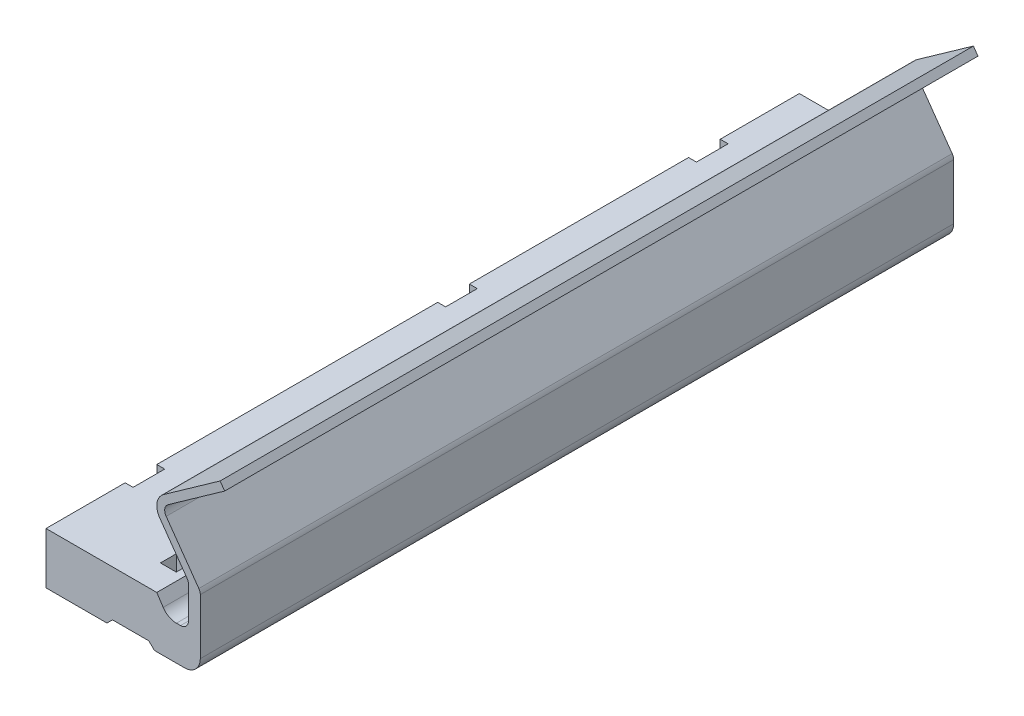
ISO-10303-21;
HEADER;
FILE_DESCRIPTION(('STEP AP214'),'2;1');
FILE_NAME('part.step','',(''),(''),'','','');
FILE_SCHEMA(('AUTOMOTIVE_DESIGN { 1 0 10303 214 1 1 1 1 }'));
ENDSEC;
DATA;
#1=APPLICATION_CONTEXT('core data for automotive mechanical design processes');
#2=APPLICATION_PROTOCOL_DEFINITION('international standard','automotive_design',2000,#1);
#3=PRODUCT_CONTEXT('',#1,'mechanical');
#4=PRODUCT('Part','Part','',(#3));
#5=PRODUCT_RELATED_PRODUCT_CATEGORY('part','',(#4));
#6=PRODUCT_DEFINITION_FORMATION('','',#4);
#7=PRODUCT_DEFINITION_CONTEXT('part definition',#1,'design');
#8=PRODUCT_DEFINITION('design','',#6,#7);
#9=PRODUCT_DEFINITION_SHAPE('','',#8);
#10=(LENGTH_UNIT() NAMED_UNIT(*) SI_UNIT(.MILLI.,.METRE.));
#11=(NAMED_UNIT(*) PLANE_ANGLE_UNIT() SI_UNIT($,.RADIAN.));
#12=(NAMED_UNIT(*) SI_UNIT($,.STERADIAN.) SOLID_ANGLE_UNIT());
#13=UNCERTAINTY_MEASURE_WITH_UNIT(LENGTH_MEASURE(1.E-05),#10,'distance_accuracy_value','');
#14=(GEOMETRIC_REPRESENTATION_CONTEXT(3) GLOBAL_UNCERTAINTY_ASSIGNED_CONTEXT((#13)) GLOBAL_UNIT_ASSIGNED_CONTEXT((#10,
#11,#12)) REPRESENTATION_CONTEXT('',''));
#15=CARTESIAN_POINT('',(0.,0.,0.));
#16=DIRECTION('',(0.,0.,1.));
#17=DIRECTION('',(1.,0.,0.));
#18=AXIS2_PLACEMENT_3D('',#15,#16,#17);
#19=CARTESIAN_POINT('',(-84.9718083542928,6.58933091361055,13.0215958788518));
#20=DIRECTION('',(-1.,0.,0.));
#21=DIRECTION('',(0.,0.,1.));
#22=AXIS2_PLACEMENT_3D('',#19,#20,#21);
#23=PLANE('',#22);
#24=DIRECTION('',(0.,1.,0.));
#25=VECTOR('',#24,1.);
#26=CARTESIAN_POINT('',(-84.9718083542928,6.58833091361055,-13.7284041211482));
#27=LINE('',#26,#25);
#28=CARTESIAN_POINT('',(-84.9718083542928,6.58933091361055,-13.7284041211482));
#29=VERTEX_POINT('',#28);
#30=CARTESIAN_POINT('',(-84.9718083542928,9.83933091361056,-13.7284041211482));
#31=VERTEX_POINT('',#30);
#32=EDGE_CURVE('E535',#29,#31,#27,.T.);
#33=ORIENTED_EDGE('',*,*,#32,.T.);
#34=DIRECTION('',(0.,0.,-1.));
#35=VECTOR('',#34,1.);
#36=CARTESIAN_POINT('',(-84.9718083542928,9.83933091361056,13.0215958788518));
#37=LINE('',#36,#35);
#38=CARTESIAN_POINT('',(-84.9718083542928,9.83933091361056,-27.5784041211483));
#39=VERTEX_POINT('',#38);
#40=EDGE_CURVE('E613',#31,#39,#37,.T.);
#41=ORIENTED_EDGE('',*,*,#40,.T.);
#42=DIRECTION('',(0.,1.,0.));
#43=VECTOR('',#42,1.);
#44=CARTESIAN_POINT('',(-84.9718083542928,6.58833091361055,-27.5784041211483));
#45=LINE('',#44,#43);
#46=CARTESIAN_POINT('',(-84.9718083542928,6.58933091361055,-27.5784041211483));
#47=VERTEX_POINT('',#46);
#48=EDGE_CURVE('E557',#47,#39,#45,.T.);
#49=ORIENTED_EDGE('',*,*,#48,.F.);
#50=DIRECTION('',(0.,0.,-1.));
#51=VECTOR('',#50,1.);
#52=CARTESIAN_POINT('',(-84.9718083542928,6.58933091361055,13.0215958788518));
#53=LINE('',#52,#51);
#54=EDGE_CURVE('E27',#29,#47,#53,.T.);
#55=ORIENTED_EDGE('',*,*,#54,.F.);
#56=EDGE_LOOP('',(#33,#41,#49,#55));
#57=FACE_BOUND('',#56,.T.);
#58=ADVANCED_FACE('F16',(#57),#23,.T.);
#59=DIRECTION('',(0.,1.,0.));
#60=VECTOR('',#59,1.);
#61=CARTESIAN_POINT('',(-84.9718083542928,6.58833091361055,-11.7284041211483));
#62=LINE('',#61,#60);
#63=CARTESIAN_POINT('',(-84.9718083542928,6.58933091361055,-11.7284041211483));
#64=VERTEX_POINT('',#63);
#65=CARTESIAN_POINT('',(-84.9718083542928,9.83933091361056,-11.7284041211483));
#66=VERTEX_POINT('',#65);
#67=EDGE_CURVE('E35',#64,#66,#62,.T.);
#68=ORIENTED_EDGE('',*,*,#67,.F.);
#69=CARTESIAN_POINT('',(-84.9718083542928,6.58933091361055,6.02159587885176));
#70=VERTEX_POINT('',#69);
#71=EDGE_CURVE('E25',#70,#64,#53,.T.);
#72=ORIENTED_EDGE('',*,*,#71,.F.);
#73=DIRECTION('',(0.,1.,0.));
#74=VECTOR('',#73,1.);
#75=CARTESIAN_POINT('',(-84.9718083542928,6.58833091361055,6.02159587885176));
#76=LINE('',#75,#74);
#77=CARTESIAN_POINT('',(-84.9718083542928,9.83933091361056,6.02159587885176));
#78=VERTEX_POINT('',#77);
#79=EDGE_CURVE('E850',#70,#78,#76,.T.);
#80=ORIENTED_EDGE('',*,*,#79,.T.);
#81=EDGE_CURVE('E612',#78,#66,#37,.T.);
#82=ORIENTED_EDGE('',*,*,#81,.T.);
#83=EDGE_LOOP('',(#68,#72,#80,#82));
#84=FACE_BOUND('',#83,.T.);
#85=ADVANCED_FACE('F1207',(#84),#23,.T.);
#86=DIRECTION('',(0.,1.,0.));
#87=VECTOR('',#86,1.);
#88=CARTESIAN_POINT('',(-84.9718083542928,6.58833091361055,8.02159587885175));
#89=LINE('',#88,#87);
#90=CARTESIAN_POINT('',(-84.9718083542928,6.58933091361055,8.02159587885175));
#91=VERTEX_POINT('',#90);
#92=CARTESIAN_POINT('',(-84.9718083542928,9.83933091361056,8.02159587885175));
#93=VERTEX_POINT('',#92);
#94=EDGE_CURVE('E851',#91,#93,#89,.T.);
#95=ORIENTED_EDGE('',*,*,#94,.F.);
#96=CARTESIAN_POINT('',(-84.9718083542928,6.58933091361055,13.0215958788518));
#97=VERTEX_POINT('',#96);
#98=EDGE_CURVE('E11',#97,#91,#53,.T.);
#99=ORIENTED_EDGE('',*,*,#98,.F.);
#100=DIRECTION('',(0.,1.,0.));
#101=VECTOR('',#100,1.);
#102=CARTESIAN_POINT('',(-84.9718083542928,6.58933091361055,13.0215958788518));
#103=LINE('',#102,#101);
#104=CARTESIAN_POINT('',(-84.9718083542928,9.83933091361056,13.0215958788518));
#105=VERTEX_POINT('',#104);
#106=EDGE_CURVE('E689',#97,#105,#103,.T.);
#107=ORIENTED_EDGE('',*,*,#106,.T.);
#108=EDGE_CURVE('E20',#105,#93,#37,.T.);
#109=ORIENTED_EDGE('',*,*,#108,.T.);
#110=EDGE_LOOP('',(#95,#99,#107,#109));
#111=FACE_BOUND('',#110,.T.);
#112=ADVANCED_FACE('F1230',(#111),#23,.T.);
#113=DIRECTION('',(0.,1.,0.));
#114=VECTOR('',#113,1.);
#115=CARTESIAN_POINT('',(-84.9718083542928,6.58833091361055,-29.5784041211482));
#116=LINE('',#115,#114);
#117=CARTESIAN_POINT('',(-84.9718083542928,6.58933091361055,-29.5784041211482));
#118=VERTEX_POINT('',#117);
#119=CARTESIAN_POINT('',(-84.9718083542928,9.83933091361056,-29.5784041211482));
#120=VERTEX_POINT('',#119);
#121=EDGE_CURVE('E769',#118,#120,#116,.T.);
#122=ORIENTED_EDGE('',*,*,#121,.T.);
#123=CARTESIAN_POINT('',(-84.9718083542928,9.83933091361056,-34.5784041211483));
#124=VERTEX_POINT('',#123);
#125=EDGE_CURVE('E614',#120,#124,#37,.T.);
#126=ORIENTED_EDGE('',*,*,#125,.T.);
#127=DIRECTION('',(0.,1.,0.));
#128=VECTOR('',#127,1.);
#129=CARTESIAN_POINT('',(-84.9718083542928,6.58933091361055,-34.5784041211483));
#130=LINE('',#129,#128);
#131=CARTESIAN_POINT('',(-84.9718083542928,6.58933091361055,-34.5784041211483));
#132=VERTEX_POINT('',#131);
#133=EDGE_CURVE('E757',#132,#124,#130,.T.);
#134=ORIENTED_EDGE('',*,*,#133,.F.);
#135=EDGE_CURVE('E28',#118,#132,#53,.T.);
#136=ORIENTED_EDGE('',*,*,#135,.F.);
#137=EDGE_LOOP('',(#122,#126,#134,#136));
#138=FACE_BOUND('',#137,.T.);
#139=ADVANCED_FACE('F18',(#138),#23,.T.);
#140=CARTESIAN_POINT('',(-84.9718083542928,6.58933091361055,13.0215958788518));
#141=DIRECTION('',(0.,-1.,0.));
#142=DIRECTION('',(-1.,0.,0.));
#143=AXIS2_PLACEMENT_3D('',#140,#141,#142);
#144=PLANE('',#143);
#145=DIRECTION('',(-1.,0.,0.));
#146=VECTOR('',#145,1.);
#147=CARTESIAN_POINT('',(-84.9718083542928,6.58933091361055,-13.7284041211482));
#148=LINE('',#147,#146);
#149=CARTESIAN_POINT('',(-84.4718083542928,6.58933091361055,-13.7284041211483));
#150=VERTEX_POINT('',#149);
#151=EDGE_CURVE('E538',#150,#29,#148,.T.);
#152=ORIENTED_EDGE('',*,*,#151,.T.);
#153=ORIENTED_EDGE('',*,*,#54,.T.);
#154=DIRECTION('',(1.,0.,0.));
#155=VECTOR('',#154,1.);
#156=CARTESIAN_POINT('',(-84.9718083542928,6.58933091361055,-27.5784041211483));
#157=LINE('',#156,#155);
#158=CARTESIAN_POINT('',(-84.4718083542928,6.58933091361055,-27.5784041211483));
#159=VERTEX_POINT('',#158);
#160=EDGE_CURVE('E778',#47,#159,#157,.T.);
#161=ORIENTED_EDGE('',*,*,#160,.T.);
#162=DIRECTION('',(0.,0.,-1.));
#163=VECTOR('',#162,1.);
#164=CARTESIAN_POINT('',(-84.4718083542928,6.58933091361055,-29.5784041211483));
#165=LINE('',#164,#163);
#166=CARTESIAN_POINT('',(-84.4718083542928,6.58933091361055,-29.5784041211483));
#167=VERTEX_POINT('',#166);
#168=EDGE_CURVE('E760',#159,#167,#165,.T.);
#169=ORIENTED_EDGE('',*,*,#168,.T.);
#170=DIRECTION('',(-1.,0.,0.));
#171=VECTOR('',#170,1.);
#172=CARTESIAN_POINT('',(-84.9718083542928,6.58933091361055,-29.5784041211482));
#173=LINE('',#172,#171);
#174=EDGE_CURVE('E780',#167,#118,#173,.T.);
#175=ORIENTED_EDGE('',*,*,#174,.T.);
#176=ORIENTED_EDGE('',*,*,#135,.T.);
#177=DIRECTION('',(-1.,0.,0.));
#178=VECTOR('',#177,1.);
#179=CARTESIAN_POINT('',(-84.9718083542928,6.58933091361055,-34.5784041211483));
#180=LINE('',#179,#178);
#181=CARTESIAN_POINT('',(-81.1218083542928,6.58933091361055,-34.5784041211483));
#182=VERTEX_POINT('',#181);
#183=EDGE_CURVE('E691',#182,#132,#180,.T.);
#184=ORIENTED_EDGE('',*,*,#183,.F.);
#185=DIRECTION('',(0.,0.,-1.));
#186=VECTOR('',#185,1.);
#187=CARTESIAN_POINT('',(-81.1218083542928,6.58933091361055,13.0215958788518));
#188=LINE('',#187,#186);
#189=CARTESIAN_POINT('',(-81.1218083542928,6.58933091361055,13.0215958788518));
#190=VERTEX_POINT('',#189);
#191=EDGE_CURVE('E559',#190,#182,#188,.T.);
#192=ORIENTED_EDGE('',*,*,#191,.F.);
#193=DIRECTION('',(-1.,0.,0.));
#194=VECTOR('',#193,1.);
#195=CARTESIAN_POINT('',(-84.9718083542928,6.58933091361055,13.0215958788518));
#196=LINE('',#195,#194);
#197=EDGE_CURVE('E562',#190,#97,#196,.T.);
#198=ORIENTED_EDGE('',*,*,#197,.T.);
#199=ORIENTED_EDGE('',*,*,#98,.T.);
#200=DIRECTION('',(1.,0.,0.));
#201=VECTOR('',#200,1.);
#202=CARTESIAN_POINT('',(-84.9718083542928,6.58933091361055,8.02159587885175));
#203=LINE('',#202,#201);
#204=CARTESIAN_POINT('',(-84.4718083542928,6.58933091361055,8.02159587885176));
#205=VERTEX_POINT('',#204);
#206=EDGE_CURVE('E847',#91,#205,#203,.T.);
#207=ORIENTED_EDGE('',*,*,#206,.T.);
#208=DIRECTION('',(0.,0.,-1.));
#209=VECTOR('',#208,1.);
#210=CARTESIAN_POINT('',(-84.4718083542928,6.58933091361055,8.02159587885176));
#211=LINE('',#210,#209);
#212=CARTESIAN_POINT('',(-84.4718083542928,6.58933091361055,6.02159587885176));
#213=VERTEX_POINT('',#212);
#214=EDGE_CURVE('E870',#205,#213,#211,.T.);
#215=ORIENTED_EDGE('',*,*,#214,.T.);
#216=DIRECTION('',(-1.,0.,0.));
#217=VECTOR('',#216,1.);
#218=CARTESIAN_POINT('',(-84.9718083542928,6.58933091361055,6.02159587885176));
#219=LINE('',#218,#217);
#220=EDGE_CURVE('E867',#213,#70,#219,.T.);
#221=ORIENTED_EDGE('',*,*,#220,.T.);
#222=ORIENTED_EDGE('',*,*,#71,.T.);
#223=DIRECTION('',(1.,0.,0.));
#224=VECTOR('',#223,1.);
#225=CARTESIAN_POINT('',(-84.9718083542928,6.58933091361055,-11.7284041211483));
#226=LINE('',#225,#224);
#227=CARTESIAN_POINT('',(-84.4718083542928,6.58933091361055,-11.7284041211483));
#228=VERTEX_POINT('',#227);
#229=EDGE_CURVE('E1202',#64,#228,#226,.T.);
#230=ORIENTED_EDGE('',*,*,#229,.T.);
#231=DIRECTION('',(0.,0.,-1.));
#232=VECTOR('',#231,1.);
#233=CARTESIAN_POINT('',(-84.4718083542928,6.58933091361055,-11.7284041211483));
#234=LINE('',#233,#232);
#235=EDGE_CURVE('E553',#228,#150,#234,.T.);
#236=ORIENTED_EDGE('',*,*,#235,.T.);
#237=EDGE_LOOP('',(#152,#153,#161,#169,#175,#176,#184,#192,#198,#199,#207,#215,#221,#222,#230,#236));
#238=FACE_BOUND('',#237,.T.);
#239=ADVANCED_FACE('F549',(#238),#144,.T.);
#240=CARTESIAN_POINT('',(-80.7718083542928,6.93933091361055,13.0215958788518));
#241=DIRECTION('',(0.707106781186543,-0.707106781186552,0.));
#242=DIRECTION('',(-0.707106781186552,-0.707106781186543,0.));
#243=AXIS2_PLACEMENT_3D('',#240,#241,#242);
#244=PLANE('',#243);
#245=DIRECTION('',(-0.707106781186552,-0.707106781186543,0.));
#246=VECTOR('',#245,1.);
#247=CARTESIAN_POINT('',(-80.7718083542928,6.93933091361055,-34.5784041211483));
#248=LINE('',#247,#246);
#249=CARTESIAN_POINT('',(-80.7718083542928,6.93933091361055,-34.5784041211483));
#250=VERTEX_POINT('',#249);
#251=EDGE_CURVE('E694',#250,#182,#248,.T.);
#252=ORIENTED_EDGE('',*,*,#251,.F.);
#253=DIRECTION('',(0.,0.,-1.));
#254=VECTOR('',#253,1.);
#255=CARTESIAN_POINT('',(-80.7718083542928,6.93933091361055,13.0215958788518));
#256=LINE('',#255,#254);
#257=CARTESIAN_POINT('',(-80.7718083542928,6.93933091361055,13.0215958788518));
#258=VERTEX_POINT('',#257);
#259=EDGE_CURVE('E565',#258,#250,#256,.T.);
#260=ORIENTED_EDGE('',*,*,#259,.F.);
#261=DIRECTION('',(-0.707106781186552,-0.707106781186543,0.));
#262=VECTOR('',#261,1.);
#263=CARTESIAN_POINT('',(-80.7718083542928,6.93933091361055,13.0215958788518));
#264=LINE('',#263,#262);
#265=EDGE_CURVE('E624',#258,#190,#264,.T.);
#266=ORIENTED_EDGE('',*,*,#265,.T.);
#267=ORIENTED_EDGE('',*,*,#191,.T.);
#268=EDGE_LOOP('',(#252,#260,#266,#267));
#269=FACE_BOUND('',#268,.T.);
#270=ADVANCED_FACE('F1236',(#269),#244,.T.);
#271=CARTESIAN_POINT('',(-78.4718083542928,6.93933091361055,13.0215958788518));
#272=DIRECTION('',(0.,-1.,0.));
#273=DIRECTION('',(-1.,0.,0.));
#274=AXIS2_PLACEMENT_3D('',#271,#272,#273);
#275=PLANE('',#274);
#276=DIRECTION('',(1.,0.,0.));
#277=VECTOR('',#276,1.);
#278=CARTESIAN_POINT('',(-78.4718083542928,6.93933091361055,11.2915958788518));
#279=LINE('',#278,#277);
#280=CARTESIAN_POINT('',(-79.4718083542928,6.93933091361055,11.2915958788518));
#281=VERTEX_POINT('',#280);
#282=CARTESIAN_POINT('',(-78.4718083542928,6.93933091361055,11.2915958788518));
#283=VERTEX_POINT('',#282);
#284=EDGE_CURVE('E1182',#281,#283,#279,.T.);
#285=ORIENTED_EDGE('',*,*,#284,.T.);
#286=DIRECTION('',(0.,0.,-1.));
#287=VECTOR('',#286,1.);
#288=CARTESIAN_POINT('',(-78.4718083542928,6.93933091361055,13.0215958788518));
#289=LINE('',#288,#287);
#290=CARTESIAN_POINT('',(-78.4718083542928,6.93933091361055,13.0215958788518));
#291=VERTEX_POINT('',#290);
#292=EDGE_CURVE('E567',#291,#283,#289,.T.);
#293=ORIENTED_EDGE('',*,*,#292,.F.);
#294=DIRECTION('',(-1.,0.,0.));
#295=VECTOR('',#294,1.);
#296=CARTESIAN_POINT('',(-78.4718083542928,6.93933091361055,13.0215958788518));
#297=LINE('',#296,#295);
#298=EDGE_CURVE('E627',#291,#258,#297,.T.);
#299=ORIENTED_EDGE('',*,*,#298,.T.);
#300=ORIENTED_EDGE('',*,*,#259,.T.);
#301=DIRECTION('',(-1.,0.,0.));
#302=VECTOR('',#301,1.);
#303=CARTESIAN_POINT('',(-78.4718083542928,6.93933091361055,-34.5784041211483));
#304=LINE('',#303,#302);
#305=CARTESIAN_POINT('',(-78.4718083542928,6.93933091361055,-34.5784041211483));
#306=VERTEX_POINT('',#305);
#307=EDGE_CURVE('E697',#306,#250,#304,.T.);
#308=ORIENTED_EDGE('',*,*,#307,.F.);
#309=CARTESIAN_POINT('',(-78.4718083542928,6.93933091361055,-32.8284041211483));
#310=VERTEX_POINT('',#309);
#311=EDGE_CURVE('E574',#310,#306,#289,.T.);
#312=ORIENTED_EDGE('',*,*,#311,.F.);
#313=DIRECTION('',(-1.,0.,0.));
#314=VECTOR('',#313,1.);
#315=CARTESIAN_POINT('',(-78.4718083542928,6.93933091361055,-32.8284041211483));
#316=LINE('',#315,#314);
#317=CARTESIAN_POINT('',(-79.4718083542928,6.93933091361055,-32.8284041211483));
#318=VERTEX_POINT('',#317);
#319=EDGE_CURVE('E905',#310,#318,#316,.T.);
#320=ORIENTED_EDGE('',*,*,#319,.T.);
#321=DIRECTION('',(0.,0.,1.));
#322=VECTOR('',#321,1.);
#323=CARTESIAN_POINT('',(-79.4718083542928,6.93933091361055,-32.8284041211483));
#324=LINE('',#323,#322);
#325=CARTESIAN_POINT('',(-79.4718083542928,6.93933091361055,-31.8284041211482));
#326=VERTEX_POINT('',#325);
#327=EDGE_CURVE('E931',#318,#326,#324,.T.);
#328=ORIENTED_EDGE('',*,*,#327,.T.);
#329=DIRECTION('',(1.,0.,0.));
#330=VECTOR('',#329,1.);
#331=CARTESIAN_POINT('',(-78.4718083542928,6.93933091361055,-31.8284041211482));
#332=LINE('',#331,#330);
#333=CARTESIAN_POINT('',(-78.4718083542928,6.93933091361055,-31.8284041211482));
#334=VERTEX_POINT('',#333);
#335=EDGE_CURVE('E928',#326,#334,#332,.T.);
#336=ORIENTED_EDGE('',*,*,#335,.T.);
#337=CARTESIAN_POINT('',(-78.4718083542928,6.93933091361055,-28.9084041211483));
#338=VERTEX_POINT('',#337);
#339=EDGE_CURVE('E571',#338,#334,#289,.T.);
#340=ORIENTED_EDGE('',*,*,#339,.F.);
#341=DIRECTION('',(-1.,0.,0.));
#342=VECTOR('',#341,1.);
#343=CARTESIAN_POINT('',(-78.4718083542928,6.93933091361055,-28.9084041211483));
#344=LINE('',#343,#342);
#345=CARTESIAN_POINT('',(-79.4718083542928,6.93933091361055,-28.9084041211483));
#346=VERTEX_POINT('',#345);
#347=EDGE_CURVE('E783',#338,#346,#344,.T.);
#348=ORIENTED_EDGE('',*,*,#347,.T.);
#349=DIRECTION('',(0.,0.,1.));
#350=VECTOR('',#349,1.);
#351=CARTESIAN_POINT('',(-79.4718083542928,6.93933091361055,-28.9084041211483));
#352=LINE('',#351,#350);
#353=CARTESIAN_POINT('',(-79.4718083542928,6.93933091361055,-27.9084041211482));
#354=VERTEX_POINT('',#353);
#355=EDGE_CURVE('E809',#346,#354,#352,.T.);
#356=ORIENTED_EDGE('',*,*,#355,.T.);
#357=DIRECTION('',(1.,0.,0.));
#358=VECTOR('',#357,1.);
#359=CARTESIAN_POINT('',(-78.4718083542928,6.93933091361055,-27.9084041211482));
#360=LINE('',#359,#358);
#361=CARTESIAN_POINT('',(-78.4718083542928,6.93933091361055,-27.9084041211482));
#362=VERTEX_POINT('',#361);
#363=EDGE_CURVE('E806',#354,#362,#360,.T.);
#364=ORIENTED_EDGE('',*,*,#363,.T.);
#365=CARTESIAN_POINT('',(-78.4718083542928,6.93933091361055,-24.9884041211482));
#366=VERTEX_POINT('',#365);
#367=EDGE_CURVE('E1878',#366,#362,#289,.T.);
#368=ORIENTED_EDGE('',*,*,#367,.F.);
#369=DIRECTION('',(-1.,0.,0.));
#370=VECTOR('',#369,1.);
#371=CARTESIAN_POINT('',(-78.4718083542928,6.93933091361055,-24.9884041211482));
#372=LINE('',#371,#370);
#373=CARTESIAN_POINT('',(-79.4718083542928,6.93933091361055,-24.9884041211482));
#374=VERTEX_POINT('',#373);
#375=EDGE_CURVE('E815',#366,#374,#372,.T.);
#376=ORIENTED_EDGE('',*,*,#375,.T.);
#377=DIRECTION('',(0.,0.,1.));
#378=VECTOR('',#377,1.);
#379=CARTESIAN_POINT('',(-79.4718083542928,6.93933091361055,-24.9884041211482));
#380=LINE('',#379,#378);
#381=CARTESIAN_POINT('',(-79.4718083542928,6.93933091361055,-23.9884041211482));
#382=VERTEX_POINT('',#381);
#383=EDGE_CURVE('E841',#374,#382,#380,.T.);
#384=ORIENTED_EDGE('',*,*,#383,.T.);
#385=DIRECTION('',(1.,0.,0.));
#386=VECTOR('',#385,1.);
#387=CARTESIAN_POINT('',(-78.4718083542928,6.93933091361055,-23.9884041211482));
#388=LINE('',#387,#386);
#389=CARTESIAN_POINT('',(-78.4718083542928,6.93933091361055,-23.9884041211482));
#390=VERTEX_POINT('',#389);
#391=EDGE_CURVE('E838',#382,#390,#388,.T.);
#392=ORIENTED_EDGE('',*,*,#391,.T.);
#393=CARTESIAN_POINT('',(-78.4718083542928,6.93933091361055,-21.0684041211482));
#394=VERTEX_POINT('',#393);
#395=EDGE_CURVE('E1847',#394,#390,#289,.T.);
#396=ORIENTED_EDGE('',*,*,#395,.F.);
#397=DIRECTION('',(-1.,0.,0.));
#398=VECTOR('',#397,1.);
#399=CARTESIAN_POINT('',(-78.4718083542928,6.93933091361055,-21.0684041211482));
#400=LINE('',#399,#398);
#401=CARTESIAN_POINT('',(-79.4718083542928,6.93933091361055,-21.0684041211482));
#402=VERTEX_POINT('',#401);
#403=EDGE_CURVE('E873',#394,#402,#400,.T.);
#404=ORIENTED_EDGE('',*,*,#403,.T.);
#405=DIRECTION('',(0.,0.,1.));
#406=VECTOR('',#405,1.);
#407=CARTESIAN_POINT('',(-79.4718083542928,6.93933091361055,-21.0684041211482));
#408=LINE('',#407,#406);
#409=CARTESIAN_POINT('',(-79.4718083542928,6.93933091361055,-20.0684041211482));
#410=VERTEX_POINT('',#409);
#411=EDGE_CURVE('E899',#402,#410,#408,.T.);
#412=ORIENTED_EDGE('',*,*,#411,.T.);
#413=DIRECTION('',(1.,0.,0.));
#414=VECTOR('',#413,1.);
#415=CARTESIAN_POINT('',(-78.4718083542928,6.93933091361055,-20.0684041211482));
#416=LINE('',#415,#414);
#417=CARTESIAN_POINT('',(-78.4718083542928,6.93933091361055,-20.0684041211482));
#418=VERTEX_POINT('',#417);
#419=EDGE_CURVE('E896',#410,#418,#416,.T.);
#420=ORIENTED_EDGE('',*,*,#419,.T.);
#421=CARTESIAN_POINT('',(-78.4718083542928,6.93933091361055,-17.1484041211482));
#422=VERTEX_POINT('',#421);
#423=EDGE_CURVE('E1848',#422,#418,#289,.T.);
#424=ORIENTED_EDGE('',*,*,#423,.F.);
#425=DIRECTION('',(-1.,0.,0.));
#426=VECTOR('',#425,1.);
#427=CARTESIAN_POINT('',(-78.4718083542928,6.93933091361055,-17.1484041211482));
#428=LINE('',#427,#426);
#429=CARTESIAN_POINT('',(-79.4718083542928,6.93933091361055,-17.1484041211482));
#430=VERTEX_POINT('',#429);
#431=EDGE_CURVE('E937',#422,#430,#428,.T.);
#432=ORIENTED_EDGE('',*,*,#431,.T.);
#433=DIRECTION('',(0.,0.,1.));
#434=VECTOR('',#433,1.);
#435=CARTESIAN_POINT('',(-79.4718083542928,6.93933091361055,-17.1484041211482));
#436=LINE('',#435,#434);
#437=CARTESIAN_POINT('',(-79.4718083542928,6.93933091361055,-16.1484041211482));
#438=VERTEX_POINT('',#437);
#439=EDGE_CURVE('E963',#430,#438,#436,.T.);
#440=ORIENTED_EDGE('',*,*,#439,.T.);
#441=DIRECTION('',(1.,0.,0.));
#442=VECTOR('',#441,1.);
#443=CARTESIAN_POINT('',(-78.4718083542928,6.93933091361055,-16.1484041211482));
#444=LINE('',#443,#442);
#445=CARTESIAN_POINT('',(-78.4718083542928,6.93933091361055,-16.1484041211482));
#446=VERTEX_POINT('',#445);
#447=EDGE_CURVE('E960',#438,#446,#444,.T.);
#448=ORIENTED_EDGE('',*,*,#447,.T.);
#449=CARTESIAN_POINT('',(-78.4718083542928,6.93933091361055,-13.2284041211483));
#450=VERTEX_POINT('',#449);
#451=EDGE_CURVE('E1894',#450,#446,#289,.T.);
#452=ORIENTED_EDGE('',*,*,#451,.F.);
#453=DIRECTION('',(-1.,0.,0.));
#454=VECTOR('',#453,1.);
#455=CARTESIAN_POINT('',(-78.4718083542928,6.93933091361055,-13.2284041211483));
#456=LINE('',#455,#454);
#457=CARTESIAN_POINT('',(-79.4718083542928,6.93933091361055,-13.2284041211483));
#458=VERTEX_POINT('',#457);
#459=EDGE_CURVE('E969',#450,#458,#456,.T.);
#460=ORIENTED_EDGE('',*,*,#459,.T.);
#461=DIRECTION('',(0.,0.,1.));
#462=VECTOR('',#461,1.);
#463=CARTESIAN_POINT('',(-79.4718083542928,6.93933091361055,-13.2284041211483));
#464=LINE('',#463,#462);
#465=CARTESIAN_POINT('',(-79.4718083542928,6.93933091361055,-12.2284041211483));
#466=VERTEX_POINT('',#465);
#467=EDGE_CURVE('E995',#458,#466,#464,.T.);
#468=ORIENTED_EDGE('',*,*,#467,.T.);
#469=DIRECTION('',(1.,0.,0.));
#470=VECTOR('',#469,1.);
#471=CARTESIAN_POINT('',(-78.4718083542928,6.93933091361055,-12.2284041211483));
#472=LINE('',#471,#470);
#473=CARTESIAN_POINT('',(-78.4718083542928,6.93933091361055,-12.2284041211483));
#474=VERTEX_POINT('',#473);
#475=EDGE_CURVE('E992',#466,#474,#472,.T.);
#476=ORIENTED_EDGE('',*,*,#475,.T.);
#477=CARTESIAN_POINT('',(-78.4718083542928,6.93933091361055,-9.30840412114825));
#478=VERTEX_POINT('',#477);
#479=EDGE_CURVE('E1906',#478,#474,#289,.T.);
#480=ORIENTED_EDGE('',*,*,#479,.F.);
#481=DIRECTION('',(-1.,0.,0.));
#482=VECTOR('',#481,1.);
#483=CARTESIAN_POINT('',(-78.4718083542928,6.93933091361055,-9.30840412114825));
#484=LINE('',#483,#482);
#485=CARTESIAN_POINT('',(-79.4718083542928,6.93933091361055,-9.30840412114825));
#486=VERTEX_POINT('',#485);
#487=EDGE_CURVE('E1001',#478,#486,#484,.T.);
#488=ORIENTED_EDGE('',*,*,#487,.T.);
#489=DIRECTION('',(0.,0.,1.));
#490=VECTOR('',#489,1.);
#491=CARTESIAN_POINT('',(-79.4718083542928,6.93933091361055,-9.30840412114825));
#492=LINE('',#491,#490);
#493=CARTESIAN_POINT('',(-79.4718083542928,6.93933091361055,-8.30840412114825));
#494=VERTEX_POINT('',#493);
#495=EDGE_CURVE('E1027',#486,#494,#492,.T.);
#496=ORIENTED_EDGE('',*,*,#495,.T.);
#497=DIRECTION('',(1.,0.,0.));
#498=VECTOR('',#497,1.);
#499=CARTESIAN_POINT('',(-78.4718083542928,6.93933091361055,-8.30840412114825));
#500=LINE('',#499,#498);
#501=CARTESIAN_POINT('',(-78.4718083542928,6.93933091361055,-8.30840412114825));
#502=VERTEX_POINT('',#501);
#503=EDGE_CURVE('E1024',#494,#502,#500,.T.);
#504=ORIENTED_EDGE('',*,*,#503,.T.);
#505=CARTESIAN_POINT('',(-78.4718083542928,6.93933091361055,-5.38840412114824));
#506=VERTEX_POINT('',#505);
#507=EDGE_CURVE('E1918',#506,#502,#289,.T.);
#508=ORIENTED_EDGE('',*,*,#507,.F.);
#509=DIRECTION('',(-1.,0.,0.));
#510=VECTOR('',#509,1.);
#511=CARTESIAN_POINT('',(-78.4718083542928,6.93933091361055,-5.38840412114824));
#512=LINE('',#511,#510);
#513=CARTESIAN_POINT('',(-79.4718083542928,6.93933091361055,-5.38840412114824));
#514=VERTEX_POINT('',#513);
#515=EDGE_CURVE('E1033',#506,#514,#512,.T.);
#516=ORIENTED_EDGE('',*,*,#515,.T.);
#517=DIRECTION('',(0.,0.,1.));
#518=VECTOR('',#517,1.);
#519=CARTESIAN_POINT('',(-79.4718083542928,6.93933091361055,-5.38840412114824));
#520=LINE('',#519,#518);
#521=CARTESIAN_POINT('',(-79.4718083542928,6.93933091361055,-4.38840412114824));
#522=VERTEX_POINT('',#521);
#523=EDGE_CURVE('E1059',#514,#522,#520,.T.);
#524=ORIENTED_EDGE('',*,*,#523,.T.);
#525=DIRECTION('',(1.,0.,0.));
#526=VECTOR('',#525,1.);
#527=CARTESIAN_POINT('',(-78.4718083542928,6.93933091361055,-4.38840412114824));
#528=LINE('',#527,#526);
#529=CARTESIAN_POINT('',(-78.4718083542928,6.93933091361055,-4.38840412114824));
#530=VERTEX_POINT('',#529);
#531=EDGE_CURVE('E1056',#522,#530,#528,.T.);
#532=ORIENTED_EDGE('',*,*,#531,.T.);
#533=CARTESIAN_POINT('',(-78.4718083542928,6.93933091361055,-1.46840412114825));
#534=VERTEX_POINT('',#533);
#535=EDGE_CURVE('E1930',#534,#530,#289,.T.);
#536=ORIENTED_EDGE('',*,*,#535,.F.);
#537=DIRECTION('',(-1.,0.,0.));
#538=VECTOR('',#537,1.);
#539=CARTESIAN_POINT('',(-78.4718083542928,6.93933091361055,-1.46840412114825));
#540=LINE('',#539,#538);
#541=CARTESIAN_POINT('',(-79.4718083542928,6.93933091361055,-1.46840412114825));
#542=VERTEX_POINT('',#541);
#543=EDGE_CURVE('E1065',#534,#542,#540,.T.);
#544=ORIENTED_EDGE('',*,*,#543,.T.);
#545=DIRECTION('',(0.,0.,1.));
#546=VECTOR('',#545,1.);
#547=CARTESIAN_POINT('',(-79.4718083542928,6.93933091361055,-1.46840412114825));
#548=LINE('',#547,#546);
#549=CARTESIAN_POINT('',(-79.4718083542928,6.93933091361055,-0.46840412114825));
#550=VERTEX_POINT('',#549);
#551=EDGE_CURVE('E1091',#542,#550,#548,.T.);
#552=ORIENTED_EDGE('',*,*,#551,.T.);
#553=DIRECTION('',(1.,0.,0.));
#554=VECTOR('',#553,1.);
#555=CARTESIAN_POINT('',(-78.4718083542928,6.93933091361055,-0.46840412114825));
#556=LINE('',#555,#554);
#557=CARTESIAN_POINT('',(-78.4718083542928,6.93933091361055,-0.46840412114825));
#558=VERTEX_POINT('',#557);
#559=EDGE_CURVE('E1088',#550,#558,#556,.T.);
#560=ORIENTED_EDGE('',*,*,#559,.T.);
#561=CARTESIAN_POINT('',(-78.4718083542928,6.93933091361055,2.45159587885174));
#562=VERTEX_POINT('',#561);
#563=EDGE_CURVE('E1942',#562,#558,#289,.T.);
#564=ORIENTED_EDGE('',*,*,#563,.F.);
#565=DIRECTION('',(-1.,0.,0.));
#566=VECTOR('',#565,1.);
#567=CARTESIAN_POINT('',(-78.4718083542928,6.93933091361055,2.45159587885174));
#568=LINE('',#567,#566);
#569=CARTESIAN_POINT('',(-79.4718083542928,6.93933091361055,2.45159587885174));
#570=VERTEX_POINT('',#569);
#571=EDGE_CURVE('E1097',#562,#570,#568,.T.);
#572=ORIENTED_EDGE('',*,*,#571,.T.);
#573=DIRECTION('',(0.,0.,1.));
#574=VECTOR('',#573,1.);
#575=CARTESIAN_POINT('',(-79.4718083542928,6.93933091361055,2.45159587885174));
#576=LINE('',#575,#574);
#577=CARTESIAN_POINT('',(-79.4718083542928,6.93933091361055,3.45159587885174));
#578=VERTEX_POINT('',#577);
#579=EDGE_CURVE('E1123',#570,#578,#576,.T.);
#580=ORIENTED_EDGE('',*,*,#579,.T.);
#581=DIRECTION('',(1.,0.,0.));
#582=VECTOR('',#581,1.);
#583=CARTESIAN_POINT('',(-78.4718083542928,6.93933091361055,3.45159587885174));
#584=LINE('',#583,#582);
#585=CARTESIAN_POINT('',(-78.4718083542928,6.93933091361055,3.45159587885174));
#586=VERTEX_POINT('',#585);
#587=EDGE_CURVE('E1120',#578,#586,#584,.T.);
#588=ORIENTED_EDGE('',*,*,#587,.T.);
#589=CARTESIAN_POINT('',(-78.4718083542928,6.93933091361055,6.37159587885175));
#590=VERTEX_POINT('',#589);
#591=EDGE_CURVE('E1801',#590,#586,#289,.T.);
#592=ORIENTED_EDGE('',*,*,#591,.F.);
#593=DIRECTION('',(-1.,0.,0.));
#594=VECTOR('',#593,1.);
#595=CARTESIAN_POINT('',(-78.4718083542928,6.93933091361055,6.37159587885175));
#596=LINE('',#595,#594);
#597=CARTESIAN_POINT('',(-79.4718083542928,6.93933091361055,6.37159587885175));
#598=VERTEX_POINT('',#597);
#599=EDGE_CURVE('E1129',#590,#598,#596,.T.);
#600=ORIENTED_EDGE('',*,*,#599,.T.);
#601=DIRECTION('',(0.,0.,1.));
#602=VECTOR('',#601,1.);
#603=CARTESIAN_POINT('',(-79.4718083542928,6.93933091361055,6.37159587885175));
#604=LINE('',#603,#602);
#605=CARTESIAN_POINT('',(-79.4718083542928,6.93933091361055,7.37159587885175));
#606=VERTEX_POINT('',#605);
#607=EDGE_CURVE('E1155',#598,#606,#604,.T.);
#608=ORIENTED_EDGE('',*,*,#607,.T.);
#609=DIRECTION('',(1.,0.,0.));
#610=VECTOR('',#609,1.);
#611=CARTESIAN_POINT('',(-78.4718083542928,6.93933091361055,7.37159587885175));
#612=LINE('',#611,#610);
#613=CARTESIAN_POINT('',(-78.4718083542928,6.93933091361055,7.37159587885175));
#614=VERTEX_POINT('',#613);
#615=EDGE_CURVE('E1152',#606,#614,#612,.T.);
#616=ORIENTED_EDGE('',*,*,#615,.T.);
#617=CARTESIAN_POINT('',(-78.4718083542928,6.93933091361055,10.2915958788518));
#618=VERTEX_POINT('',#617);
#619=EDGE_CURVE('E570',#618,#614,#289,.T.);
#620=ORIENTED_EDGE('',*,*,#619,.F.);
#621=DIRECTION('',(-1.,0.,0.));
#622=VECTOR('',#621,1.);
#623=CARTESIAN_POINT('',(-78.4718083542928,6.93933091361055,10.2915958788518));
#624=LINE('',#623,#622);
#625=CARTESIAN_POINT('',(-79.4718083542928,6.93933091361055,10.2915958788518));
#626=VERTEX_POINT('',#625);
#627=EDGE_CURVE('E1161',#618,#626,#624,.T.);
#628=ORIENTED_EDGE('',*,*,#627,.T.);
#629=DIRECTION('',(0.,0.,1.));
#630=VECTOR('',#629,1.);
#631=CARTESIAN_POINT('',(-79.4718083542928,6.93933091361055,10.2915958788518));
#632=LINE('',#631,#630);
#633=EDGE_CURVE('E1185',#626,#281,#632,.T.);
#634=ORIENTED_EDGE('',*,*,#633,.T.);
#635=EDGE_LOOP('',(#285,#293,#299,#300,#308,#312,#320,#328,#336,#340,#348,#356,#364,#368,#376,
#384,#392,#396,#404,#412,#420,#424,#432,#440,#448,#452,#460,#468,#476,#480,#488,#496,#504,#508,
#516,#524,#532,#536,#544,#552,#560,#564,#572,#580,#588,#592,#600,#608,#616,#620,#628,#634));
#636=FACE_BOUND('',#635,.T.);
#637=ADVANCED_FACE('F1270',(#636),#275,.T.);
#638=CARTESIAN_POINT('',(-78.4718083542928,6.93933091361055,13.0215958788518));
#639=DIRECTION('',(-0.707106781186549,-0.707106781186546,0.));
#640=DIRECTION('',(-0.707106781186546,0.707106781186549,0.));
#641=AXIS2_PLACEMENT_3D('',#638,#639,#640);
#642=PLANE('',#641);
#643=DIRECTION('',(-0.707106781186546,0.707106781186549,0.));
#644=VECTOR('',#643,1.);
#645=CARTESIAN_POINT('',(-78.4718083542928,6.93933091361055,-34.5784041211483));
#646=LINE('',#645,#644);
#647=CARTESIAN_POINT('',(-78.1218083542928,6.58933091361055,-34.5784041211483));
#648=VERTEX_POINT('',#647);
#649=EDGE_CURVE('E700',#648,#306,#646,.T.);
#650=ORIENTED_EDGE('',*,*,#649,.F.);
#651=DIRECTION('',(0.,0.,-1.));
#652=VECTOR('',#651,1.);
#653=CARTESIAN_POINT('',(-78.1218083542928,6.58933091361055,13.0215958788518));
#654=LINE('',#653,#652);
#655=CARTESIAN_POINT('',(-78.1218083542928,6.58933091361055,13.0215958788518));
#656=VERTEX_POINT('',#655);
#657=EDGE_CURVE('E572',#656,#648,#654,.T.);
#658=ORIENTED_EDGE('',*,*,#657,.F.);
#659=DIRECTION('',(-0.707106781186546,0.707106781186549,0.));
#660=VECTOR('',#659,1.);
#661=CARTESIAN_POINT('',(-78.4718083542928,6.93933091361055,13.0215958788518));
#662=LINE('',#661,#660);
#663=EDGE_CURVE('E631',#656,#291,#662,.T.);
#664=ORIENTED_EDGE('',*,*,#663,.T.);
#665=ORIENTED_EDGE('',*,*,#292,.T.);
#666=DIRECTION('',(0.,0.,-1.));
#667=VECTOR('',#666,1.);
#668=CARTESIAN_POINT('',(-78.4718083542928,6.93933091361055,13.0215958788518));
#669=LINE('',#668,#667);
#670=EDGE_CURVE('E1188',#283,#618,#669,.T.);
#671=ORIENTED_EDGE('',*,*,#670,.T.);
#672=ORIENTED_EDGE('',*,*,#619,.T.);
#673=DIRECTION('',(0.,0.,-1.));
#674=VECTOR('',#673,1.);
#675=CARTESIAN_POINT('',(-78.4718083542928,6.93933091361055,13.0215958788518));
#676=LINE('',#675,#674);
#677=EDGE_CURVE('E1158',#614,#590,#676,.T.);
#678=ORIENTED_EDGE('',*,*,#677,.T.);
#679=ORIENTED_EDGE('',*,*,#591,.T.);
#680=DIRECTION('',(0.,0.,-1.));
#681=VECTOR('',#680,1.);
#682=CARTESIAN_POINT('',(-78.4718083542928,6.93933091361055,13.0215958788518));
#683=LINE('',#682,#681);
#684=EDGE_CURVE('E1126',#586,#562,#683,.T.);
#685=ORIENTED_EDGE('',*,*,#684,.T.);
#686=ORIENTED_EDGE('',*,*,#563,.T.);
#687=DIRECTION('',(0.,0.,-1.));
#688=VECTOR('',#687,1.);
#689=CARTESIAN_POINT('',(-78.4718083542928,6.93933091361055,13.0215958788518));
#690=LINE('',#689,#688);
#691=EDGE_CURVE('E1094',#558,#534,#690,.T.);
#692=ORIENTED_EDGE('',*,*,#691,.T.);
#693=ORIENTED_EDGE('',*,*,#535,.T.);
#694=DIRECTION('',(0.,0.,-1.));
#695=VECTOR('',#694,1.);
#696=CARTESIAN_POINT('',(-78.4718083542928,6.93933091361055,13.0215958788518));
#697=LINE('',#696,#695);
#698=EDGE_CURVE('E1062',#530,#506,#697,.T.);
#699=ORIENTED_EDGE('',*,*,#698,.T.);
#700=ORIENTED_EDGE('',*,*,#507,.T.);
#701=DIRECTION('',(0.,0.,-1.));
#702=VECTOR('',#701,1.);
#703=CARTESIAN_POINT('',(-78.4718083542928,6.93933091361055,13.0215958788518));
#704=LINE('',#703,#702);
#705=EDGE_CURVE('E1030',#502,#478,#704,.T.);
#706=ORIENTED_EDGE('',*,*,#705,.T.);
#707=ORIENTED_EDGE('',*,*,#479,.T.);
#708=DIRECTION('',(0.,0.,-1.));
#709=VECTOR('',#708,1.);
#710=CARTESIAN_POINT('',(-78.4718083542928,6.93933091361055,13.0215958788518));
#711=LINE('',#710,#709);
#712=EDGE_CURVE('E998',#474,#450,#711,.T.);
#713=ORIENTED_EDGE('',*,*,#712,.T.);
#714=ORIENTED_EDGE('',*,*,#451,.T.);
#715=DIRECTION('',(0.,0.,-1.));
#716=VECTOR('',#715,1.);
#717=CARTESIAN_POINT('',(-78.4718083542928,6.93933091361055,13.0215958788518));
#718=LINE('',#717,#716);
#719=EDGE_CURVE('E966',#446,#422,#718,.T.);
#720=ORIENTED_EDGE('',*,*,#719,.T.);
#721=ORIENTED_EDGE('',*,*,#423,.T.);
#722=DIRECTION('',(0.,0.,-1.));
#723=VECTOR('',#722,1.);
#724=CARTESIAN_POINT('',(-78.4718083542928,6.93933091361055,13.0215958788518));
#725=LINE('',#724,#723);
#726=EDGE_CURVE('E902',#418,#394,#725,.T.);
#727=ORIENTED_EDGE('',*,*,#726,.T.);
#728=ORIENTED_EDGE('',*,*,#395,.T.);
#729=DIRECTION('',(0.,0.,-1.));
#730=VECTOR('',#729,1.);
#731=CARTESIAN_POINT('',(-78.4718083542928,6.93933091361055,13.0215958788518));
#732=LINE('',#731,#730);
#733=EDGE_CURVE('E844',#390,#366,#732,.T.);
#734=ORIENTED_EDGE('',*,*,#733,.T.);
#735=ORIENTED_EDGE('',*,*,#367,.T.);
#736=DIRECTION('',(0.,0.,-1.));
#737=VECTOR('',#736,1.);
#738=CARTESIAN_POINT('',(-78.4718083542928,6.93933091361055,13.0215958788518));
#739=LINE('',#738,#737);
#740=EDGE_CURVE('E812',#362,#338,#739,.T.);
#741=ORIENTED_EDGE('',*,*,#740,.T.);
#742=ORIENTED_EDGE('',*,*,#339,.T.);
#743=DIRECTION('',(0.,0.,-1.));
#744=VECTOR('',#743,1.);
#745=CARTESIAN_POINT('',(-78.4718083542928,6.93933091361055,13.0215958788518));
#746=LINE('',#745,#744);
#747=EDGE_CURVE('E934',#334,#310,#746,.T.);
#748=ORIENTED_EDGE('',*,*,#747,.T.);
#749=ORIENTED_EDGE('',*,*,#311,.T.);
#750=EDGE_LOOP('',(#650,#658,#664,#665,#671,#672,#678,#679,#685,#686,#692,#693,#699,#700,#706,
#707,#713,#714,#720,#721,#727,#728,#734,#735,#741,#742,#748,#749));
#751=FACE_BOUND('',#750,.T.);
#752=ADVANCED_FACE('F1273',(#751),#642,.T.);
#753=CARTESIAN_POINT('',(-78.1218083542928,6.58933091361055,13.0215958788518));
#754=DIRECTION('',(0.,-1.,0.));
#755=DIRECTION('',(-1.,0.,0.));
#756=AXIS2_PLACEMENT_3D('',#753,#754,#755);
#757=PLANE('',#756);
#758=DIRECTION('',(-1.,0.,0.));
#759=VECTOR('',#758,1.);
#760=CARTESIAN_POINT('',(-78.1218083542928,6.58933091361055,-34.5784041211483));
#761=LINE('',#760,#759);
#762=CARTESIAN_POINT('',(-76.2218083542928,6.58933091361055,-34.5784041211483));
#763=VERTEX_POINT('',#762);
#764=EDGE_CURVE('E703',#763,#648,#761,.T.);
#765=ORIENTED_EDGE('',*,*,#764,.F.);
#766=DIRECTION('',(0.,0.,-1.));
#767=VECTOR('',#766,1.);
#768=CARTESIAN_POINT('',(-76.2218083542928,6.58933091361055,13.0215958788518));
#769=LINE('',#768,#767);
#770=CARTESIAN_POINT('',(-76.2218083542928,6.58933091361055,13.0215958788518));
#771=VERTEX_POINT('',#770);
#772=EDGE_CURVE('E575',#771,#763,#769,.T.);
#773=ORIENTED_EDGE('',*,*,#772,.F.);
#774=DIRECTION('',(-1.,0.,0.));
#775=VECTOR('',#774,1.);
#776=CARTESIAN_POINT('',(-78.1218083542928,6.58933091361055,13.0215958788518));
#777=LINE('',#776,#775);
#778=EDGE_CURVE('E636',#771,#656,#777,.T.);
#779=ORIENTED_EDGE('',*,*,#778,.T.);
#780=ORIENTED_EDGE('',*,*,#657,.T.);
#781=EDGE_LOOP('',(#765,#773,#779,#780));
#782=FACE_BOUND('',#781,.T.);
#783=ADVANCED_FACE('F1277',(#782),#757,.T.);
#784=CARTESIAN_POINT('',(-76.2218083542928,7.58933091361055,13.0215958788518));
#785=DIRECTION('',(0.,0.,-1.));
#786=DIRECTION('',(-1.,0.,0.));
#787=AXIS2_PLACEMENT_3D('',#784,#785,#786);
#788=CYLINDRICAL_SURFACE('',#787,1.);
#789=CARTESIAN_POINT('',(-76.2218083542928,7.58933091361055,-34.5784041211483));
#790=DIRECTION('',(0.,0.,-1.));
#791=DIRECTION('',(-1.,0.,0.));
#792=AXIS2_PLACEMENT_3D('',#789,#790,#791);
#793=CIRCLE('',#792,1.);
#794=CARTESIAN_POINT('',(-75.2218083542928,7.58933091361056,-34.5784041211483));
#795=VERTEX_POINT('',#794);
#796=EDGE_CURVE('E706',#795,#763,#793,.T.);
#797=ORIENTED_EDGE('',*,*,#796,.F.);
#798=DIRECTION('',(0.,0.,-1.));
#799=VECTOR('',#798,1.);
#800=CARTESIAN_POINT('',(-75.2218083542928,7.58933091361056,13.0215958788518));
#801=LINE('',#800,#799);
#802=CARTESIAN_POINT('',(-75.2218083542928,7.58933091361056,13.0215958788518));
#803=VERTEX_POINT('',#802);
#804=EDGE_CURVE('E577',#803,#795,#801,.T.);
#805=ORIENTED_EDGE('',*,*,#804,.F.);
#806=CARTESIAN_POINT('',(-76.2218083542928,7.58933091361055,13.0215958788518));
#807=DIRECTION('',(0.,0.,-1.));
#808=DIRECTION('',(-1.,0.,0.));
#809=AXIS2_PLACEMENT_3D('',#806,#807,#808);
#810=CIRCLE('',#809,1.);
#811=EDGE_CURVE('E639',#803,#771,#810,.T.);
#812=ORIENTED_EDGE('',*,*,#811,.T.);
#813=ORIENTED_EDGE('',*,*,#772,.T.);
#814=EDGE_LOOP('',(#797,#805,#812,#813));
#815=FACE_BOUND('',#814,.T.);
#816=ADVANCED_FACE('F1281',(#815),#788,.T.);
#817=CARTESIAN_POINT('',(-75.2218083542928,7.58933091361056,13.0215958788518));
#818=DIRECTION('',(1.,0.,0.));
#819=DIRECTION('',(0.,0.,-1.));
#820=AXIS2_PLACEMENT_3D('',#817,#818,#819);
#821=PLANE('',#820);
#822=DIRECTION('',(0.,-1.,0.));
#823=VECTOR('',#822,1.);
#824=CARTESIAN_POINT('',(-75.2218083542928,7.58933091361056,-34.5784041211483));
#825=LINE('',#824,#823);
#826=CARTESIAN_POINT('',(-75.2218083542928,11.0940511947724,-34.5784041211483));
#827=VERTEX_POINT('',#826);
#828=EDGE_CURVE('E709',#827,#795,#825,.T.);
#829=ORIENTED_EDGE('',*,*,#828,.F.);
#830=DIRECTION('',(0.,0.,-1.));
#831=VECTOR('',#830,1.);
#832=CARTESIAN_POINT('',(-75.2218083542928,11.0940511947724,13.0215958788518));
#833=LINE('',#832,#831);
#834=CARTESIAN_POINT('',(-75.2218083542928,11.0940511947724,13.0215958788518));
#835=VERTEX_POINT('',#834);
#836=EDGE_CURVE('E579',#835,#827,#833,.T.);
#837=ORIENTED_EDGE('',*,*,#836,.F.);
#838=DIRECTION('',(0.,-1.,0.));
#839=VECTOR('',#838,1.);
#840=CARTESIAN_POINT('',(-75.2218083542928,7.58933091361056,13.0215958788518));
#841=LINE('',#840,#839);
#842=EDGE_CURVE('E642',#835,#803,#841,.T.);
#843=ORIENTED_EDGE('',*,*,#842,.T.);
#844=ORIENTED_EDGE('',*,*,#804,.T.);
#845=EDGE_LOOP('',(#829,#837,#843,#844));
#846=FACE_BOUND('',#845,.T.);
#847=ADVANCED_FACE('F1285',(#846),#821,.T.);
#848=CARTESIAN_POINT('',(-75.7218083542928,11.0940511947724,13.0215958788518));
#849=DIRECTION('',(0.,0.,-1.));
#850=DIRECTION('',(-1.,0.,0.));
#851=AXIS2_PLACEMENT_3D('',#848,#849,#850);
#852=CYLINDRICAL_SURFACE('',#851,0.5);
#853=CARTESIAN_POINT('',(-75.7218083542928,11.0940511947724,-34.5784041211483));
#854=DIRECTION('',(0.,0.,-1.));
#855=DIRECTION('',(-1.,0.,0.));
#856=AXIS2_PLACEMENT_3D('',#853,#854,#855);
#857=CIRCLE('',#856,0.5);
#858=CARTESIAN_POINT('',(-75.31377172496,11.3830254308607,-34.5784041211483));
#859=VERTEX_POINT('',#858);
#860=EDGE_CURVE('E712',#859,#827,#857,.T.);
#861=ORIENTED_EDGE('',*,*,#860,.F.);
#862=DIRECTION('',(0.,0.,-1.));
#863=VECTOR('',#862,1.);
#864=CARTESIAN_POINT('',(-75.31377172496,11.3830254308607,13.0215958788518));
#865=LINE('',#864,#863);
#866=CARTESIAN_POINT('',(-75.31377172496,11.3830254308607,13.0215958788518));
#867=VERTEX_POINT('',#866);
#868=EDGE_CURVE('E581',#867,#859,#865,.T.);
#869=ORIENTED_EDGE('',*,*,#868,.F.);
#870=CARTESIAN_POINT('',(-75.7218083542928,11.0940511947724,13.0215958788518));
#871=DIRECTION('',(0.,0.,-1.));
#872=DIRECTION('',(-1.,0.,0.));
#873=AXIS2_PLACEMENT_3D('',#870,#871,#872);
#874=CIRCLE('',#873,0.5);
#875=EDGE_CURVE('E645',#867,#835,#874,.T.);
#876=ORIENTED_EDGE('',*,*,#875,.T.);
#877=ORIENTED_EDGE('',*,*,#836,.T.);
#878=EDGE_LOOP('',(#861,#869,#876,#877));
#879=FACE_BOUND('',#878,.T.);
#880=ADVANCED_FACE('F1289',(#879),#852,.T.);
#881=CARTESIAN_POINT('',(-75.31377172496,11.3830254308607,13.0215958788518));
#882=DIRECTION('',(0.816073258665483,0.577948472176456,0.));
#883=DIRECTION('',(0.577948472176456,-0.816073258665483,0.));
#884=AXIS2_PLACEMENT_3D('',#881,#882,#883);
#885=PLANE('',#884);
#886=DIRECTION('',(0.577948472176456,-0.816073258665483,0.));
#887=VECTOR('',#886,1.);
#888=CARTESIAN_POINT('',(-75.31377172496,11.3830254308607,-34.5784041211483));
#889=LINE('',#888,#887);
#890=CARTESIAN_POINT('',(-77.3798449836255,14.3003566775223,-34.5784041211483));
#891=VERTEX_POINT('',#890);
#892=EDGE_CURVE('E715',#891,#859,#889,.T.);
#893=ORIENTED_EDGE('',*,*,#892,.F.);
#894=DIRECTION('',(0.,0.,-1.));
#895=VECTOR('',#894,1.);
#896=CARTESIAN_POINT('',(-77.3798449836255,14.3003566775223,13.0215958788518));
#897=LINE('',#896,#895);
#898=CARTESIAN_POINT('',(-77.3798449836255,14.3003566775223,13.0215958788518));
#899=VERTEX_POINT('',#898);
#900=EDGE_CURVE('E583',#899,#891,#897,.T.);
#901=ORIENTED_EDGE('',*,*,#900,.F.);
#902=DIRECTION('',(0.577948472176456,-0.816073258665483,0.));
#903=VECTOR('',#902,1.);
#904=CARTESIAN_POINT('',(-75.31377172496,11.3830254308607,13.0215958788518));
#905=LINE('',#904,#903);
#906=EDGE_CURVE('E648',#899,#867,#905,.T.);
#907=ORIENTED_EDGE('',*,*,#906,.T.);
#908=ORIENTED_EDGE('',*,*,#868,.T.);
#909=EDGE_LOOP('',(#893,#901,#907,#908));
#910=FACE_BOUND('',#909,.T.);
#911=ADVANCED_FACE('F1293',(#910),#885,.T.);
#912=CARTESIAN_POINT('',(-76.9718083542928,14.5893309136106,13.0215958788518));
#913=DIRECTION('',(0.,0.,-1.));
#914=DIRECTION('',(-1.,0.,0.));
#915=AXIS2_PLACEMENT_3D('',#912,#913,#914);
#916=CYLINDRICAL_SURFACE('',#915,0.500000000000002);
#917=CARTESIAN_POINT('',(-76.9718083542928,14.5893309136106,-34.5784041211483));
#918=DIRECTION('',(0.,0.,1.));
#919=DIRECTION('',(-1.,0.,0.));
#920=AXIS2_PLACEMENT_3D('',#917,#918,#919);
#921=CIRCLE('',#920,0.500000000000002);
#922=CARTESIAN_POINT('',(-77.260782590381,14.9973675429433,-34.5784041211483));
#923=VERTEX_POINT('',#922);
#924=EDGE_CURVE('E718',#923,#891,#921,.T.);
#925=ORIENTED_EDGE('',*,*,#924,.F.);
#926=DIRECTION('',(0.,0.,-1.));
#927=VECTOR('',#926,1.);
#928=CARTESIAN_POINT('',(-77.260782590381,14.9973675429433,13.0215958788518));
#929=LINE('',#928,#927);
#930=CARTESIAN_POINT('',(-77.260782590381,14.9973675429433,13.0215958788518));
#931=VERTEX_POINT('',#930);
#932=EDGE_CURVE('E585',#931,#923,#929,.T.);
#933=ORIENTED_EDGE('',*,*,#932,.F.);
#934=CARTESIAN_POINT('',(-76.9718083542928,14.5893309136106,13.0215958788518));
#935=DIRECTION('',(0.,0.,1.));
#936=DIRECTION('',(-1.,0.,0.));
#937=AXIS2_PLACEMENT_3D('',#934,#935,#936);
#938=CIRCLE('',#937,0.500000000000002);
#939=EDGE_CURVE('E651',#931,#899,#938,.T.);
#940=ORIENTED_EDGE('',*,*,#939,.T.);
#941=ORIENTED_EDGE('',*,*,#900,.T.);
#942=EDGE_LOOP('',(#925,#933,#940,#941));
#943=FACE_BOUND('',#942,.T.);
#944=ADVANCED_FACE('F1297',(#943),#916,.F.);
#945=CARTESIAN_POINT('',(-77.260782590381,14.9973675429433,13.0215958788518));
#946=DIRECTION('',(0.577948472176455,-0.816073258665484,0.));
#947=DIRECTION('',(-0.816073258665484,-0.577948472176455,0.));
#948=AXIS2_PLACEMENT_3D('',#945,#946,#947);
#949=PLANE('',#948);
#950=DIRECTION('',(-0.816073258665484,-0.577948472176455,0.));
#951=VECTOR('',#950,1.);
#952=CARTESIAN_POINT('',(-77.260782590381,14.9973675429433,-34.5784041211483));
#953=LINE('',#952,#951);
#954=CARTESIAN_POINT('',(-73.6828341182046,17.5312942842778,-34.5784041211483));
#955=VERTEX_POINT('',#954);
#956=EDGE_CURVE('E721',#955,#923,#953,.T.);
#957=ORIENTED_EDGE('',*,*,#956,.F.);
#958=DIRECTION('',(0.,0.,-1.));
#959=VECTOR('',#958,1.);
#960=CARTESIAN_POINT('',(-73.6828341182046,17.5312942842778,13.0215958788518));
#961=LINE('',#960,#959);
#962=CARTESIAN_POINT('',(-73.6828341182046,17.5312942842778,13.0215958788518));
#963=VERTEX_POINT('',#962);
#964=EDGE_CURVE('E587',#963,#955,#961,.T.);
#965=ORIENTED_EDGE('',*,*,#964,.F.);
#966=DIRECTION('',(-0.816073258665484,-0.577948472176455,0.));
#967=VECTOR('',#966,1.);
#968=CARTESIAN_POINT('',(-77.260782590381,14.9973675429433,13.0215958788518));
#969=LINE('',#968,#967);
#970=EDGE_CURVE('E654',#963,#931,#969,.T.);
#971=ORIENTED_EDGE('',*,*,#970,.T.);
#972=ORIENTED_EDGE('',*,*,#932,.T.);
#973=EDGE_LOOP('',(#957,#965,#971,#972));
#974=FACE_BOUND('',#973,.T.);
#975=ADVANCED_FACE('F1301',(#974),#949,.T.);
#976=CARTESIAN_POINT('',(-73.9718083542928,17.9393309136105,13.0215958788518));
#977=DIRECTION('',(0.816073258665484,0.577948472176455,0.));
#978=DIRECTION('',(0.577948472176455,-0.816073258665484,0.));
#979=AXIS2_PLACEMENT_3D('',#976,#977,#978);
#980=PLANE('',#979);
#981=DIRECTION('',(0.577948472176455,-0.816073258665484,0.));
#982=VECTOR('',#981,1.);
#983=CARTESIAN_POINT('',(-73.9718083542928,17.9393309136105,-34.5784041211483));
#984=LINE('',#983,#982);
#985=CARTESIAN_POINT('',(-73.9718083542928,17.9393309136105,-34.5784041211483));
#986=VERTEX_POINT('',#985);
#987=EDGE_CURVE('E724',#986,#955,#984,.T.);
#988=ORIENTED_EDGE('',*,*,#987,.F.);
#989=DIRECTION('',(0.,0.,-1.));
#990=VECTOR('',#989,1.);
#991=CARTESIAN_POINT('',(-73.9718083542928,17.9393309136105,13.0215958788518));
#992=LINE('',#991,#990);
#993=CARTESIAN_POINT('',(-73.9718083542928,17.9393309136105,13.0215958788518));
#994=VERTEX_POINT('',#993);
#995=EDGE_CURVE('E589',#994,#986,#992,.T.);
#996=ORIENTED_EDGE('',*,*,#995,.F.);
#997=DIRECTION('',(0.577948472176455,-0.816073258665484,0.));
#998=VECTOR('',#997,1.);
#999=CARTESIAN_POINT('',(-73.9718083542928,17.9393309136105,13.0215958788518));
#1000=LINE('',#999,#998);
#1001=EDGE_CURVE('E657',#994,#963,#1000,.T.);
#1002=ORIENTED_EDGE('',*,*,#1001,.T.);
#1003=ORIENTED_EDGE('',*,*,#964,.T.);
#1004=EDGE_LOOP('',(#988,#996,#1002,#1003));
#1005=FACE_BOUND('',#1004,.T.);
#1006=ADVANCED_FACE('F1305',(#1005),#980,.T.);
#1007=CARTESIAN_POINT('',(-77.5497568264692,15.405404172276,13.0215958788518));
#1008=DIRECTION('',(-0.577948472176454,0.816073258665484,0.));
#1009=DIRECTION('',(0.816073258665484,0.577948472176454,0.));
#1010=AXIS2_PLACEMENT_3D('',#1007,#1008,#1009);
#1011=PLANE('',#1010);
#1012=DIRECTION('',(0.816073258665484,0.577948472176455,0.));
#1013=VECTOR('',#1012,1.);
#1014=CARTESIAN_POINT('',(-77.5497568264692,15.405404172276,-34.5784041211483));
#1015=LINE('',#1014,#1013);
#1016=CARTESIAN_POINT('',(-77.5497568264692,15.405404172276,-34.5784041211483));
#1017=VERTEX_POINT('',#1016);
#1018=EDGE_CURVE('E727',#1017,#986,#1015,.T.);
#1019=ORIENTED_EDGE('',*,*,#1018,.F.);
#1020=DIRECTION('',(0.,0.,-1.));
#1021=VECTOR('',#1020,1.);
#1022=CARTESIAN_POINT('',(-77.5497568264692,15.405404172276,13.0215958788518));
#1023=LINE('',#1022,#1021);
#1024=CARTESIAN_POINT('',(-77.5497568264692,15.405404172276,13.0215958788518));
#1025=VERTEX_POINT('',#1024);
#1026=EDGE_CURVE('E591',#1025,#1017,#1023,.T.);
#1027=ORIENTED_EDGE('',*,*,#1026,.F.);
#1028=DIRECTION('',(0.816073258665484,0.577948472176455,0.));
#1029=VECTOR('',#1028,1.);
#1030=CARTESIAN_POINT('',(-77.5497568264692,15.405404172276,13.0215958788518));
#1031=LINE('',#1030,#1029);
#1032=EDGE_CURVE('E660',#1025,#994,#1031,.T.);
#1033=ORIENTED_EDGE('',*,*,#1032,.T.);
#1034=ORIENTED_EDGE('',*,*,#995,.T.);
#1035=EDGE_LOOP('',(#1019,#1027,#1033,#1034));
#1036=FACE_BOUND('',#1035,.T.);
#1037=ADVANCED_FACE('F1309',(#1036),#1011,.T.);
#1038=CARTESIAN_POINT('',(-76.9718083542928,14.5893309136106,13.0215958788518));
#1039=DIRECTION('',(0.,0.,-1.));
#1040=DIRECTION('',(-1.,0.,0.));
#1041=AXIS2_PLACEMENT_3D('',#1038,#1039,#1040);
#1042=CYLINDRICAL_SURFACE('',#1041,1.);
#1043=CARTESIAN_POINT('',(-76.9718083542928,14.5893309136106,-34.5784041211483));
#1044=DIRECTION('',(0.,0.,-1.));
#1045=DIRECTION('',(-1.,0.,0.));
#1046=AXIS2_PLACEMENT_3D('',#1043,#1044,#1045);
#1047=CIRCLE('',#1046,1.);
#1048=CARTESIAN_POINT('',(-77.7878816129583,14.0113824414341,-34.5784041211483));
#1049=VERTEX_POINT('',#1048);
#1050=EDGE_CURVE('E730',#1049,#1017,#1047,.T.);
#1051=ORIENTED_EDGE('',*,*,#1050,.F.);
#1052=DIRECTION('',(0.,0.,-1.));
#1053=VECTOR('',#1052,1.);
#1054=CARTESIAN_POINT('',(-77.7878816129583,14.0113824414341,13.0215958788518));
#1055=LINE('',#1054,#1053);
#1056=CARTESIAN_POINT('',(-77.7878816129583,14.0113824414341,13.0215958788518));
#1057=VERTEX_POINT('',#1056);
#1058=EDGE_CURVE('E593',#1057,#1049,#1055,.T.);
#1059=ORIENTED_EDGE('',*,*,#1058,.F.);
#1060=CARTESIAN_POINT('',(-76.9718083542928,14.5893309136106,13.0215958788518));
#1061=DIRECTION('',(0.,0.,-1.));
#1062=DIRECTION('',(-1.,0.,0.));
#1063=AXIS2_PLACEMENT_3D('',#1060,#1061,#1062);
#1064=CIRCLE('',#1063,1.);
#1065=EDGE_CURVE('E663',#1057,#1025,#1064,.T.);
#1066=ORIENTED_EDGE('',*,*,#1065,.T.);
#1067=ORIENTED_EDGE('',*,*,#1026,.T.);
#1068=EDGE_LOOP('',(#1051,#1059,#1066,#1067));
#1069=FACE_BOUND('',#1068,.T.);
#1070=ADVANCED_FACE('F1313',(#1069),#1042,.T.);
#1071=CARTESIAN_POINT('',(-76.06377172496,11.5769094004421,13.0215958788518));
#1072=DIRECTION('',(-0.816073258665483,-0.577948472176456,0.));
#1073=DIRECTION('',(-0.577948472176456,0.816073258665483,0.));
#1074=AXIS2_PLACEMENT_3D('',#1071,#1072,#1073);
#1075=PLANE('',#1074);
#1076=DIRECTION('',(-0.577948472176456,0.816073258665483,0.));
#1077=VECTOR('',#1076,1.);
#1078=CARTESIAN_POINT('',(-76.06377172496,11.5769094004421,-34.5784041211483));
#1079=LINE('',#1078,#1077);
#1080=CARTESIAN_POINT('',(-76.06377172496,11.5769094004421,-34.5784041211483));
#1081=VERTEX_POINT('',#1080);
#1082=EDGE_CURVE('E733',#1081,#1049,#1079,.T.);
#1083=ORIENTED_EDGE('',*,*,#1082,.F.);
#1084=DIRECTION('',(0.,0.,-1.));
#1085=VECTOR('',#1084,1.);
#1086=CARTESIAN_POINT('',(-76.06377172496,11.5769094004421,13.0215958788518));
#1087=LINE('',#1086,#1085);
#1088=CARTESIAN_POINT('',(-76.06377172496,11.5769094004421,13.0215958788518));
#1089=VERTEX_POINT('',#1088);
#1090=EDGE_CURVE('E595',#1089,#1081,#1087,.T.);
#1091=ORIENTED_EDGE('',*,*,#1090,.F.);
#1092=DIRECTION('',(-0.577948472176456,0.816073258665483,0.));
#1093=VECTOR('',#1092,1.);
#1094=CARTESIAN_POINT('',(-76.06377172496,11.5769094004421,13.0215958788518));
#1095=LINE('',#1094,#1093);
#1096=EDGE_CURVE('E666',#1089,#1057,#1095,.T.);
#1097=ORIENTED_EDGE('',*,*,#1096,.T.);
#1098=ORIENTED_EDGE('',*,*,#1058,.T.);
#1099=EDGE_LOOP('',(#1083,#1091,#1097,#1098));
#1100=FACE_BOUND('',#1099,.T.);
#1101=ADVANCED_FACE('F1317',(#1100),#1075,.T.);
#1102=CARTESIAN_POINT('',(-76.4718083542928,11.2879351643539,13.0215958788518));
#1103=DIRECTION('',(0.,0.,-1.));
#1104=DIRECTION('',(-1.,0.,0.));
#1105=AXIS2_PLACEMENT_3D('',#1102,#1103,#1104);
#1106=CYLINDRICAL_SURFACE('',#1105,0.500000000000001);
#1107=CARTESIAN_POINT('',(-76.4718083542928,11.2879351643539,-34.5784041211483));
#1108=DIRECTION('',(0.,0.,1.));
#1109=DIRECTION('',(1.,0.,0.));
#1110=AXIS2_PLACEMENT_3D('',#1107,#1108,#1109);
#1111=CIRCLE('',#1110,0.500000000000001);
#1112=CARTESIAN_POINT('',(-75.9718083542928,11.2879351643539,-34.5784041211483));
#1113=VERTEX_POINT('',#1112);
#1114=EDGE_CURVE('E736',#1113,#1081,#1111,.T.);
#1115=ORIENTED_EDGE('',*,*,#1114,.F.);
#1116=DIRECTION('',(0.,0.,-1.));
#1117=VECTOR('',#1116,1.);
#1118=CARTESIAN_POINT('',(-75.9718083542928,11.2879351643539,13.0215958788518));
#1119=LINE('',#1118,#1117);
#1120=CARTESIAN_POINT('',(-75.9718083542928,11.2879351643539,13.0215958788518));
#1121=VERTEX_POINT('',#1120);
#1122=EDGE_CURVE('E597',#1121,#1113,#1119,.T.);
#1123=ORIENTED_EDGE('',*,*,#1122,.F.);
#1124=CARTESIAN_POINT('',(-76.4718083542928,11.2879351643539,13.0215958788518));
#1125=DIRECTION('',(0.,0.,1.));
#1126=DIRECTION('',(1.,0.,0.));
#1127=AXIS2_PLACEMENT_3D('',#1124,#1125,#1126);
#1128=CIRCLE('',#1127,0.500000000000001);
#1129=EDGE_CURVE('E669',#1121,#1089,#1128,.T.);
#1130=ORIENTED_EDGE('',*,*,#1129,.T.);
#1131=ORIENTED_EDGE('',*,*,#1090,.T.);
#1132=EDGE_LOOP('',(#1115,#1123,#1130,#1131));
#1133=FACE_BOUND('',#1132,.T.);
#1134=ADVANCED_FACE('F1321',(#1133),#1106,.F.);
#1135=CARTESIAN_POINT('',(-75.9718083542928,9.276858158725,13.0215958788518));
#1136=DIRECTION('',(-1.,0.,0.));
#1137=DIRECTION('',(0.,1.,0.));
#1138=AXIS2_PLACEMENT_3D('',#1135,#1136,#1137);
#1139=PLANE('',#1138);
#1140=DIRECTION('',(0.,1.,0.));
#1141=VECTOR('',#1140,1.);
#1142=CARTESIAN_POINT('',(-75.9718083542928,9.276858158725,-34.5784041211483));
#1143=LINE('',#1142,#1141);
#1144=CARTESIAN_POINT('',(-75.9718083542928,9.276858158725,-34.5784041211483));
#1145=VERTEX_POINT('',#1144);
#1146=EDGE_CURVE('E739',#1145,#1113,#1143,.T.);
#1147=ORIENTED_EDGE('',*,*,#1146,.F.);
#1148=DIRECTION('',(0.,0.,-1.));
#1149=VECTOR('',#1148,1.);
#1150=CARTESIAN_POINT('',(-75.9718083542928,9.276858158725,13.0215958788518));
#1151=LINE('',#1150,#1149);
#1152=CARTESIAN_POINT('',(-75.9718083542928,9.276858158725,13.0215958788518));
#1153=VERTEX_POINT('',#1152);
#1154=EDGE_CURVE('E599',#1153,#1145,#1151,.T.);
#1155=ORIENTED_EDGE('',*,*,#1154,.F.);
#1156=DIRECTION('',(0.,1.,0.));
#1157=VECTOR('',#1156,1.);
#1158=CARTESIAN_POINT('',(-75.9718083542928,9.276858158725,13.0215958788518));
#1159=LINE('',#1158,#1157);
#1160=EDGE_CURVE('E672',#1153,#1121,#1159,.T.);
#1161=ORIENTED_EDGE('',*,*,#1160,.T.);
#1162=ORIENTED_EDGE('',*,*,#1122,.T.);
#1163=EDGE_LOOP('',(#1147,#1155,#1161,#1162));
#1164=FACE_BOUND('',#1163,.T.);
#1165=ADVANCED_FACE('F1325',(#1164),#1139,.T.);
#1166=CARTESIAN_POINT('',(-76.4718083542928,9.276858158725,13.0215958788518));
#1167=DIRECTION('',(0.,0.,-1.));
#1168=DIRECTION('',(-1.,0.,0.));
#1169=AXIS2_PLACEMENT_3D('',#1166,#1167,#1168);
#1170=CYLINDRICAL_SURFACE('',#1169,0.499999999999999);
#1171=CARTESIAN_POINT('',(-76.4718083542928,9.276858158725,-34.5784041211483));
#1172=DIRECTION('',(0.,0.,1.));
#1173=DIRECTION('',(1.,0.,0.));
#1174=AXIS2_PLACEMENT_3D('',#1171,#1172,#1173);
#1175=CIRCLE('',#1174,0.499999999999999);
#1176=CARTESIAN_POINT('',(-76.4718083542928,8.776858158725,-34.5784041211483));
#1177=VERTEX_POINT('',#1176);
#1178=EDGE_CURVE('E742',#1177,#1145,#1175,.T.);
#1179=ORIENTED_EDGE('',*,*,#1178,.F.);
#1180=DIRECTION('',(0.,0.,-1.));
#1181=VECTOR('',#1180,1.);
#1182=CARTESIAN_POINT('',(-76.4718083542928,8.776858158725,13.0215958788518));
#1183=LINE('',#1182,#1181);
#1184=CARTESIAN_POINT('',(-76.4718083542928,8.776858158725,13.0215958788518));
#1185=VERTEX_POINT('',#1184);
#1186=EDGE_CURVE('E601',#1185,#1177,#1183,.T.);
#1187=ORIENTED_EDGE('',*,*,#1186,.F.);
#1188=CARTESIAN_POINT('',(-76.4718083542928,9.276858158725,13.0215958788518));
#1189=DIRECTION('',(0.,0.,1.));
#1190=DIRECTION('',(1.,0.,0.));
#1191=AXIS2_PLACEMENT_3D('',#1188,#1189,#1190);
#1192=CIRCLE('',#1191,0.499999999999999);
#1193=EDGE_CURVE('E675',#1185,#1153,#1192,.T.);
#1194=ORIENTED_EDGE('',*,*,#1193,.T.);
#1195=ORIENTED_EDGE('',*,*,#1154,.T.);
#1196=EDGE_LOOP('',(#1179,#1187,#1194,#1195));
#1197=FACE_BOUND('',#1196,.T.);
#1198=ADVANCED_FACE('F1329',(#1197),#1170,.F.);
#1199=CARTESIAN_POINT('',(-76.7318095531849,8.776858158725,13.0215958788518));
#1200=DIRECTION('',(0.,1.,0.));
#1201=DIRECTION('',(1.,0.,0.));
#1202=AXIS2_PLACEMENT_3D('',#1199,#1200,#1201);
#1203=PLANE('',#1202);
#1204=DIRECTION('',(1.,0.,0.));
#1205=VECTOR('',#1204,1.);
#1206=CARTESIAN_POINT('',(-76.7318095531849,8.776858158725,-34.5784041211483));
#1207=LINE('',#1206,#1205);
#1208=CARTESIAN_POINT('',(-76.7318095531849,8.776858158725,-34.5784041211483));
#1209=VERTEX_POINT('',#1208);
#1210=EDGE_CURVE('E745',#1209,#1177,#1207,.T.);
#1211=ORIENTED_EDGE('',*,*,#1210,.F.);
#1212=DIRECTION('',(0.,0.,-1.));
#1213=VECTOR('',#1212,1.);
#1214=CARTESIAN_POINT('',(-76.7318095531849,8.776858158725,13.0215958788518));
#1215=LINE('',#1214,#1213);
#1216=CARTESIAN_POINT('',(-76.7318095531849,8.776858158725,13.0215958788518));
#1217=VERTEX_POINT('',#1216);
#1218=EDGE_CURVE('E603',#1217,#1209,#1215,.T.);
#1219=ORIENTED_EDGE('',*,*,#1218,.F.);
#1220=DIRECTION('',(1.,0.,0.));
#1221=VECTOR('',#1220,1.);
#1222=CARTESIAN_POINT('',(-76.7318095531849,8.776858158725,13.0215958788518));
#1223=LINE('',#1222,#1221);
#1224=EDGE_CURVE('E678',#1217,#1185,#1223,.T.);
#1225=ORIENTED_EDGE('',*,*,#1224,.T.);
#1226=ORIENTED_EDGE('',*,*,#1186,.T.);
#1227=EDGE_LOOP('',(#1211,#1219,#1225,#1226));
#1228=FACE_BOUND('',#1227,.T.);
#1229=ADVANCED_FACE('F1333',(#1228),#1203,.T.);
#1230=CARTESIAN_POINT('',(-76.7318095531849,9.776858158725,13.0215958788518));
#1231=DIRECTION('',(0.,0.,-1.));
#1232=DIRECTION('',(-1.,0.,0.));
#1233=AXIS2_PLACEMENT_3D('',#1230,#1231,#1232);
#1234=CYLINDRICAL_SURFACE('',#1233,1.);
#1235=CARTESIAN_POINT('',(-76.7318095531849,9.776858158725,-34.5784041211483));
#1236=DIRECTION('',(0.,0.,1.));
#1237=DIRECTION('',(1.,0.,0.));
#1238=AXIS2_PLACEMENT_3D('',#1235,#1236,#1237);
#1239=CIRCLE('',#1238,1.);
#1240=CARTESIAN_POINT('',(-77.5660427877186,9.22544641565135,-34.5784041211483));
#1241=VERTEX_POINT('',#1240);
#1242=EDGE_CURVE('E748',#1241,#1209,#1239,.T.);
#1243=ORIENTED_EDGE('',*,*,#1242,.F.);
#1244=DIRECTION('',(0.,0.,-1.));
#1245=VECTOR('',#1244,1.);
#1246=CARTESIAN_POINT('',(-77.5660427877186,9.22544641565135,13.0215958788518));
#1247=LINE('',#1246,#1245);
#1248=CARTESIAN_POINT('',(-77.5660427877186,9.22544641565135,13.0215958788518));
#1249=VERTEX_POINT('',#1248);
#1250=EDGE_CURVE('E605',#1249,#1241,#1247,.T.);
#1251=ORIENTED_EDGE('',*,*,#1250,.F.);
#1252=CARTESIAN_POINT('',(-76.7318095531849,9.776858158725,13.0215958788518));
#1253=DIRECTION('',(0.,0.,1.));
#1254=DIRECTION('',(1.,0.,0.));
#1255=AXIS2_PLACEMENT_3D('',#1252,#1253,#1254);
#1256=CIRCLE('',#1255,1.);
#1257=EDGE_CURVE('E681',#1249,#1217,#1256,.T.);
#1258=ORIENTED_EDGE('',*,*,#1257,.T.);
#1259=ORIENTED_EDGE('',*,*,#1218,.T.);
#1260=EDGE_LOOP('',(#1243,#1251,#1258,#1259));
#1261=FACE_BOUND('',#1260,.T.);
#1262=ADVANCED_FACE('F1337',(#1261),#1234,.F.);
#1263=CARTESIAN_POINT('',(-77.9718083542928,9.83933091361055,13.0215958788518));
#1264=DIRECTION('',(0.834233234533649,0.551411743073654,0.));
#1265=DIRECTION('',(0.551411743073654,-0.834233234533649,0.));
#1266=AXIS2_PLACEMENT_3D('',#1263,#1264,#1265);
#1267=PLANE('',#1266);
#1268=DIRECTION('',(0.551411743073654,-0.834233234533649,0.));
#1269=VECTOR('',#1268,1.);
#1270=CARTESIAN_POINT('',(-77.9718083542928,9.83933091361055,-34.5784041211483));
#1271=LINE('',#1270,#1269);
#1272=CARTESIAN_POINT('',(-77.9718083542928,9.83933091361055,-34.5784041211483));
#1273=VERTEX_POINT('',#1272);
#1274=EDGE_CURVE('E751',#1273,#1241,#1271,.T.);
#1275=ORIENTED_EDGE('',*,*,#1274,.F.);
#1276=DIRECTION('',(0.,0.,-1.));
#1277=VECTOR('',#1276,1.);
#1278=CARTESIAN_POINT('',(-77.9718083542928,9.83933091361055,13.0215958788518));
#1279=LINE('',#1278,#1277);
#1280=CARTESIAN_POINT('',(-77.9718083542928,9.83933091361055,13.0215958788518));
#1281=VERTEX_POINT('',#1280);
#1282=EDGE_CURVE('E606',#1281,#1273,#1279,.T.);
#1283=ORIENTED_EDGE('',*,*,#1282,.F.);
#1284=DIRECTION('',(0.551411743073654,-0.834233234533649,0.));
#1285=VECTOR('',#1284,1.);
#1286=CARTESIAN_POINT('',(-77.9718083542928,9.83933091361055,13.0215958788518));
#1287=LINE('',#1286,#1285);
#1288=EDGE_CURVE('E684',#1281,#1249,#1287,.T.);
#1289=ORIENTED_EDGE('',*,*,#1288,.T.);
#1290=ORIENTED_EDGE('',*,*,#1250,.T.);
#1291=EDGE_LOOP('',(#1275,#1283,#1289,#1290));
#1292=FACE_BOUND('',#1291,.T.);
#1293=ADVANCED_FACE('F1341',(#1292),#1267,.T.);
#1294=CARTESIAN_POINT('',(-84.9718083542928,9.83933091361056,13.0215958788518));
#1295=DIRECTION('',(0.,1.,0.));
#1296=DIRECTION('',(1.,0.,0.));
#1297=AXIS2_PLACEMENT_3D('',#1294,#1295,#1296);
#1298=PLANE('',#1297);
#1299=DIRECTION('',(-1.,0.,0.));
#1300=VECTOR('',#1299,1.);
#1301=CARTESIAN_POINT('',(-84.9718083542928,9.83933091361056,-13.7284041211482));
#1302=LINE('',#1301,#1300);
#1303=CARTESIAN_POINT('',(-84.4718083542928,9.83933091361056,-13.7284041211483));
#1304=VERTEX_POINT('',#1303);
#1305=EDGE_CURVE('E541',#1304,#31,#1302,.T.);
#1306=ORIENTED_EDGE('',*,*,#1305,.F.);
#1307=DIRECTION('',(0.,0.,-1.));
#1308=VECTOR('',#1307,1.);
#1309=CARTESIAN_POINT('',(-84.4718083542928,9.83933091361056,-11.7284041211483));
#1310=LINE('',#1309,#1308);
#1311=CARTESIAN_POINT('',(-84.4718083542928,9.83933091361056,-11.7284041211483));
#1312=VERTEX_POINT('',#1311);
#1313=EDGE_CURVE('E545',#1312,#1304,#1310,.T.);
#1314=ORIENTED_EDGE('',*,*,#1313,.F.);
#1315=DIRECTION('',(1.,0.,0.));
#1316=VECTOR('',#1315,1.);
#1317=CARTESIAN_POINT('',(-84.9718083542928,9.83933091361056,-11.7284041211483));
#1318=LINE('',#1317,#1316);
#1319=EDGE_CURVE('E1198',#66,#1312,#1318,.T.);
#1320=ORIENTED_EDGE('',*,*,#1319,.F.);
#1321=ORIENTED_EDGE('',*,*,#81,.F.);
#1322=DIRECTION('',(-1.,0.,0.));
#1323=VECTOR('',#1322,1.);
#1324=CARTESIAN_POINT('',(-84.9718083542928,9.83933091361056,6.02159587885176));
#1325=LINE('',#1324,#1323);
#1326=CARTESIAN_POINT('',(-84.4718083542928,9.83933091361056,6.02159587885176));
#1327=VERTEX_POINT('',#1326);
#1328=EDGE_CURVE('E854',#1327,#78,#1325,.T.);
#1329=ORIENTED_EDGE('',*,*,#1328,.F.);
#1330=DIRECTION('',(0.,0.,-1.));
#1331=VECTOR('',#1330,1.);
#1332=CARTESIAN_POINT('',(-84.4718083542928,9.83933091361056,8.02159587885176));
#1333=LINE('',#1332,#1331);
#1334=CARTESIAN_POINT('',(-84.4718083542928,9.83933091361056,8.02159587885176));
#1335=VERTEX_POINT('',#1334);
#1336=EDGE_CURVE('E861',#1335,#1327,#1333,.T.);
#1337=ORIENTED_EDGE('',*,*,#1336,.F.);
#1338=DIRECTION('',(1.,0.,0.));
#1339=VECTOR('',#1338,1.);
#1340=CARTESIAN_POINT('',(-84.9718083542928,9.83933091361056,8.02159587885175));
#1341=LINE('',#1340,#1339);
#1342=EDGE_CURVE('E864',#93,#1335,#1341,.T.);
#1343=ORIENTED_EDGE('',*,*,#1342,.F.);
#1344=ORIENTED_EDGE('',*,*,#108,.F.);
#1345=DIRECTION('',(1.,0.,0.));
#1346=VECTOR('',#1345,1.);
#1347=CARTESIAN_POINT('',(-84.9718083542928,9.83933091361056,13.0215958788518));
#1348=LINE('',#1347,#1346);
#1349=EDGE_CURVE('E687',#105,#1281,#1348,.T.);
#1350=ORIENTED_EDGE('',*,*,#1349,.T.);
#1351=ORIENTED_EDGE('',*,*,#1282,.T.);
#1352=DIRECTION('',(1.,0.,0.));
#1353=VECTOR('',#1352,1.);
#1354=CARTESIAN_POINT('',(-84.9718083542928,9.83933091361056,-34.5784041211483));
#1355=LINE('',#1354,#1353);
#1356=EDGE_CURVE('E754',#124,#1273,#1355,.T.);
#1357=ORIENTED_EDGE('',*,*,#1356,.F.);
#1358=ORIENTED_EDGE('',*,*,#125,.F.);
#1359=DIRECTION('',(-1.,0.,0.));
#1360=VECTOR('',#1359,1.);
#1361=CARTESIAN_POINT('',(-84.9718083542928,9.83933091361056,-29.5784041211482));
#1362=LINE('',#1361,#1360);
#1363=CARTESIAN_POINT('',(-84.4718083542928,9.83933091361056,-29.5784041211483));
#1364=VERTEX_POINT('',#1363);
#1365=EDGE_CURVE('E767',#1364,#120,#1362,.T.);
#1366=ORIENTED_EDGE('',*,*,#1365,.F.);
#1367=DIRECTION('',(0.,0.,-1.));
#1368=VECTOR('',#1367,1.);
#1369=CARTESIAN_POINT('',(-84.4718083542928,9.83933091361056,-29.5784041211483));
#1370=LINE('',#1369,#1368);
#1371=CARTESIAN_POINT('',(-84.4718083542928,9.83933091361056,-27.5784041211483));
#1372=VERTEX_POINT('',#1371);
#1373=EDGE_CURVE('E773',#1372,#1364,#1370,.T.);
#1374=ORIENTED_EDGE('',*,*,#1373,.F.);
#1375=DIRECTION('',(1.,0.,0.));
#1376=VECTOR('',#1375,1.);
#1377=CARTESIAN_POINT('',(-84.9718083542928,9.83933091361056,-27.5784041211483));
#1378=LINE('',#1377,#1376);
#1379=EDGE_CURVE('E776',#39,#1372,#1378,.T.);
#1380=ORIENTED_EDGE('',*,*,#1379,.F.);
#1381=ORIENTED_EDGE('',*,*,#40,.F.);
#1382=EDGE_LOOP('',(#1306,#1314,#1320,#1321,#1329,#1337,#1343,#1344,#1350,#1351,#1357,#1358,
#1366,#1374,#1380,#1381));
#1383=FACE_BOUND('',#1382,.T.);
#1384=DIRECTION('',(0.,0.,-1.));
#1385=VECTOR('',#1384,1.);
#1386=CARTESIAN_POINT('',(-78.4718083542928,9.83933091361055,10.2915958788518));
#1387=LINE('',#1386,#1385);
#1388=CARTESIAN_POINT('',(-78.4718083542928,9.83933091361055,11.2915958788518));
#1389=VERTEX_POINT('',#1388);
#1390=CARTESIAN_POINT('',(-78.4718083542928,9.83933091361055,10.2915958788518));
#1391=VERTEX_POINT('',#1390);
#1392=EDGE_CURVE('E1180',#1389,#1391,#1387,.T.);
#1393=ORIENTED_EDGE('',*,*,#1392,.F.);
#1394=DIRECTION('',(1.,0.,0.));
#1395=VECTOR('',#1394,1.);
#1396=CARTESIAN_POINT('',(-78.4718083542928,9.83933091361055,11.2915958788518));
#1397=LINE('',#1396,#1395);
#1398=CARTESIAN_POINT('',(-79.4718083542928,9.83933091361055,11.2915958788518));
#1399=VERTEX_POINT('',#1398);
#1400=EDGE_CURVE('E1167',#1399,#1389,#1397,.T.);
#1401=ORIENTED_EDGE('',*,*,#1400,.F.);
#1402=DIRECTION('',(0.,0.,1.));
#1403=VECTOR('',#1402,1.);
#1404=CARTESIAN_POINT('',(-79.4718083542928,9.83933091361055,10.2915958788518));
#1405=LINE('',#1404,#1403);
#1406=CARTESIAN_POINT('',(-79.4718083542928,9.83933091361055,10.2915958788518));
#1407=VERTEX_POINT('',#1406);
#1408=EDGE_CURVE('E1174',#1407,#1399,#1405,.T.);
#1409=ORIENTED_EDGE('',*,*,#1408,.F.);
#1410=DIRECTION('',(-1.,0.,0.));
#1411=VECTOR('',#1410,1.);
#1412=CARTESIAN_POINT('',(-78.4718083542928,9.83933091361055,10.2915958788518));
#1413=LINE('',#1412,#1411);
#1414=EDGE_CURVE('E1177',#1391,#1407,#1413,.T.);
#1415=ORIENTED_EDGE('',*,*,#1414,.F.);
#1416=EDGE_LOOP('',(#1393,#1401,#1409,#1415));
#1417=FACE_BOUND('',#1416,.T.);
#1418=DIRECTION('',(0.,0.,-1.));
#1419=VECTOR('',#1418,1.);
#1420=CARTESIAN_POINT('',(-78.4718083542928,9.83933091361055,6.37159587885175));
#1421=LINE('',#1420,#1419);
#1422=CARTESIAN_POINT('',(-78.4718083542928,9.83933091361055,7.37159587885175));
#1423=VERTEX_POINT('',#1422);
#1424=CARTESIAN_POINT('',(-78.4718083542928,9.83933091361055,6.37159587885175));
#1425=VERTEX_POINT('',#1424);
#1426=EDGE_CURVE('E1150',#1423,#1425,#1421,.T.);
#1427=ORIENTED_EDGE('',*,*,#1426,.F.);
#1428=DIRECTION('',(1.,0.,0.));
#1429=VECTOR('',#1428,1.);
#1430=CARTESIAN_POINT('',(-78.4718083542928,9.83933091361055,7.37159587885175));
#1431=LINE('',#1430,#1429);
#1432=CARTESIAN_POINT('',(-79.4718083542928,9.83933091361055,7.37159587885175));
#1433=VERTEX_POINT('',#1432);
#1434=EDGE_CURVE('E1137',#1433,#1423,#1431,.T.);
#1435=ORIENTED_EDGE('',*,*,#1434,.F.);
#1436=DIRECTION('',(0.,0.,1.));
#1437=VECTOR('',#1436,1.);
#1438=CARTESIAN_POINT('',(-79.4718083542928,9.83933091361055,6.37159587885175));
#1439=LINE('',#1438,#1437);
#1440=CARTESIAN_POINT('',(-79.4718083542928,9.83933091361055,6.37159587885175));
#1441=VERTEX_POINT('',#1440);
#1442=EDGE_CURVE('E1144',#1441,#1433,#1439,.T.);
#1443=ORIENTED_EDGE('',*,*,#1442,.F.);
#1444=DIRECTION('',(-1.,0.,0.));
#1445=VECTOR('',#1444,1.);
#1446=CARTESIAN_POINT('',(-78.4718083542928,9.83933091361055,6.37159587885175));
#1447=LINE('',#1446,#1445);
#1448=EDGE_CURVE('E1147',#1425,#1441,#1447,.T.);
#1449=ORIENTED_EDGE('',*,*,#1448,.F.);
#1450=EDGE_LOOP('',(#1427,#1435,#1443,#1449));
#1451=FACE_BOUND('',#1450,.T.);
#1452=DIRECTION('',(0.,0.,-1.));
#1453=VECTOR('',#1452,1.);
#1454=CARTESIAN_POINT('',(-78.4718083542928,9.83933091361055,2.45159587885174));
#1455=LINE('',#1454,#1453);
#1456=CARTESIAN_POINT('',(-78.4718083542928,9.83933091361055,3.45159587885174));
#1457=VERTEX_POINT('',#1456);
#1458=CARTESIAN_POINT('',(-78.4718083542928,9.83933091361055,2.45159587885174));
#1459=VERTEX_POINT('',#1458);
#1460=EDGE_CURVE('E1118',#1457,#1459,#1455,.T.);
#1461=ORIENTED_EDGE('',*,*,#1460,.F.);
#1462=DIRECTION('',(1.,0.,0.));
#1463=VECTOR('',#1462,1.);
#1464=CARTESIAN_POINT('',(-78.4718083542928,9.83933091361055,3.45159587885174));
#1465=LINE('',#1464,#1463);
#1466=CARTESIAN_POINT('',(-79.4718083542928,9.83933091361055,3.45159587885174));
#1467=VERTEX_POINT('',#1466);
#1468=EDGE_CURVE('E1105',#1467,#1457,#1465,.T.);
#1469=ORIENTED_EDGE('',*,*,#1468,.F.);
#1470=DIRECTION('',(0.,0.,1.));
#1471=VECTOR('',#1470,1.);
#1472=CARTESIAN_POINT('',(-79.4718083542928,9.83933091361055,2.45159587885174));
#1473=LINE('',#1472,#1471);
#1474=CARTESIAN_POINT('',(-79.4718083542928,9.83933091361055,2.45159587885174));
#1475=VERTEX_POINT('',#1474);
#1476=EDGE_CURVE('E1112',#1475,#1467,#1473,.T.);
#1477=ORIENTED_EDGE('',*,*,#1476,.F.);
#1478=DIRECTION('',(-1.,0.,0.));
#1479=VECTOR('',#1478,1.);
#1480=CARTESIAN_POINT('',(-78.4718083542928,9.83933091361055,2.45159587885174));
#1481=LINE('',#1480,#1479);
#1482=EDGE_CURVE('E1115',#1459,#1475,#1481,.T.);
#1483=ORIENTED_EDGE('',*,*,#1482,.F.);
#1484=EDGE_LOOP('',(#1461,#1469,#1477,#1483));
#1485=FACE_BOUND('',#1484,.T.);
#1486=DIRECTION('',(0.,0.,-1.));
#1487=VECTOR('',#1486,1.);
#1488=CARTESIAN_POINT('',(-78.4718083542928,9.83933091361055,-1.46840412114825));
#1489=LINE('',#1488,#1487);
#1490=CARTESIAN_POINT('',(-78.4718083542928,9.83933091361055,-0.46840412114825));
#1491=VERTEX_POINT('',#1490);
#1492=CARTESIAN_POINT('',(-78.4718083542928,9.83933091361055,-1.46840412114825));
#1493=VERTEX_POINT('',#1492);
#1494=EDGE_CURVE('E1086',#1491,#1493,#1489,.T.);
#1495=ORIENTED_EDGE('',*,*,#1494,.F.);
#1496=DIRECTION('',(1.,0.,0.));
#1497=VECTOR('',#1496,1.);
#1498=CARTESIAN_POINT('',(-78.4718083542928,9.83933091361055,-0.46840412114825));
#1499=LINE('',#1498,#1497);
#1500=CARTESIAN_POINT('',(-79.4718083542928,9.83933091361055,-0.46840412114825));
#1501=VERTEX_POINT('',#1500);
#1502=EDGE_CURVE('E1073',#1501,#1491,#1499,.T.);
#1503=ORIENTED_EDGE('',*,*,#1502,.F.);
#1504=DIRECTION('',(0.,0.,1.));
#1505=VECTOR('',#1504,1.);
#1506=CARTESIAN_POINT('',(-79.4718083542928,9.83933091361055,-1.46840412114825));
#1507=LINE('',#1506,#1505);
#1508=CARTESIAN_POINT('',(-79.4718083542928,9.83933091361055,-1.46840412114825));
#1509=VERTEX_POINT('',#1508);
#1510=EDGE_CURVE('E1080',#1509,#1501,#1507,.T.);
#1511=ORIENTED_EDGE('',*,*,#1510,.F.);
#1512=DIRECTION('',(-1.,0.,0.));
#1513=VECTOR('',#1512,1.);
#1514=CARTESIAN_POINT('',(-78.4718083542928,9.83933091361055,-1.46840412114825));
#1515=LINE('',#1514,#1513);
#1516=EDGE_CURVE('E1083',#1493,#1509,#1515,.T.);
#1517=ORIENTED_EDGE('',*,*,#1516,.F.);
#1518=EDGE_LOOP('',(#1495,#1503,#1511,#1517));
#1519=FACE_BOUND('',#1518,.T.);
#1520=DIRECTION('',(0.,0.,-1.));
#1521=VECTOR('',#1520,1.);
#1522=CARTESIAN_POINT('',(-78.4718083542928,9.83933091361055,-5.38840412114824));
#1523=LINE('',#1522,#1521);
#1524=CARTESIAN_POINT('',(-78.4718083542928,9.83933091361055,-4.38840412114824));
#1525=VERTEX_POINT('',#1524);
#1526=CARTESIAN_POINT('',(-78.4718083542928,9.83933091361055,-5.38840412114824));
#1527=VERTEX_POINT('',#1526);
#1528=EDGE_CURVE('E1054',#1525,#1527,#1523,.T.);
#1529=ORIENTED_EDGE('',*,*,#1528,.F.);
#1530=DIRECTION('',(1.,0.,0.));
#1531=VECTOR('',#1530,1.);
#1532=CARTESIAN_POINT('',(-78.4718083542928,9.83933091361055,-4.38840412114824));
#1533=LINE('',#1532,#1531);
#1534=CARTESIAN_POINT('',(-79.4718083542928,9.83933091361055,-4.38840412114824));
#1535=VERTEX_POINT('',#1534);
#1536=EDGE_CURVE('E1041',#1535,#1525,#1533,.T.);
#1537=ORIENTED_EDGE('',*,*,#1536,.F.);
#1538=DIRECTION('',(0.,0.,1.));
#1539=VECTOR('',#1538,1.);
#1540=CARTESIAN_POINT('',(-79.4718083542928,9.83933091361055,-5.38840412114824));
#1541=LINE('',#1540,#1539);
#1542=CARTESIAN_POINT('',(-79.4718083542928,9.83933091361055,-5.38840412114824));
#1543=VERTEX_POINT('',#1542);
#1544=EDGE_CURVE('E1048',#1543,#1535,#1541,.T.);
#1545=ORIENTED_EDGE('',*,*,#1544,.F.);
#1546=DIRECTION('',(-1.,0.,0.));
#1547=VECTOR('',#1546,1.);
#1548=CARTESIAN_POINT('',(-78.4718083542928,9.83933091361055,-5.38840412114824));
#1549=LINE('',#1548,#1547);
#1550=EDGE_CURVE('E1051',#1527,#1543,#1549,.T.);
#1551=ORIENTED_EDGE('',*,*,#1550,.F.);
#1552=EDGE_LOOP('',(#1529,#1537,#1545,#1551));
#1553=FACE_BOUND('',#1552,.T.);
#1554=DIRECTION('',(0.,0.,-1.));
#1555=VECTOR('',#1554,1.);
#1556=CARTESIAN_POINT('',(-78.4718083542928,9.83933091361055,-9.30840412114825));
#1557=LINE('',#1556,#1555);
#1558=CARTESIAN_POINT('',(-78.4718083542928,9.83933091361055,-8.30840412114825));
#1559=VERTEX_POINT('',#1558);
#1560=CARTESIAN_POINT('',(-78.4718083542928,9.83933091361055,-9.30840412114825));
#1561=VERTEX_POINT('',#1560);
#1562=EDGE_CURVE('E1022',#1559,#1561,#1557,.T.);
#1563=ORIENTED_EDGE('',*,*,#1562,.F.);
#1564=DIRECTION('',(1.,0.,0.));
#1565=VECTOR('',#1564,1.);
#1566=CARTESIAN_POINT('',(-78.4718083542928,9.83933091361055,-8.30840412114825));
#1567=LINE('',#1566,#1565);
#1568=CARTESIAN_POINT('',(-79.4718083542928,9.83933091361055,-8.30840412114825));
#1569=VERTEX_POINT('',#1568);
#1570=EDGE_CURVE('E1009',#1569,#1559,#1567,.T.);
#1571=ORIENTED_EDGE('',*,*,#1570,.F.);
#1572=DIRECTION('',(0.,0.,1.));
#1573=VECTOR('',#1572,1.);
#1574=CARTESIAN_POINT('',(-79.4718083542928,9.83933091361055,-9.30840412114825));
#1575=LINE('',#1574,#1573);
#1576=CARTESIAN_POINT('',(-79.4718083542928,9.83933091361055,-9.30840412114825));
#1577=VERTEX_POINT('',#1576);
#1578=EDGE_CURVE('E1016',#1577,#1569,#1575,.T.);
#1579=ORIENTED_EDGE('',*,*,#1578,.F.);
#1580=DIRECTION('',(-1.,0.,0.));
#1581=VECTOR('',#1580,1.);
#1582=CARTESIAN_POINT('',(-78.4718083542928,9.83933091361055,-9.30840412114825));
#1583=LINE('',#1582,#1581);
#1584=EDGE_CURVE('E1019',#1561,#1577,#1583,.T.);
#1585=ORIENTED_EDGE('',*,*,#1584,.F.);
#1586=EDGE_LOOP('',(#1563,#1571,#1579,#1585));
#1587=FACE_BOUND('',#1586,.T.);
#1588=DIRECTION('',(0.,0.,-1.));
#1589=VECTOR('',#1588,1.);
#1590=CARTESIAN_POINT('',(-78.4718083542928,9.83933091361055,-13.2284041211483));
#1591=LINE('',#1590,#1589);
#1592=CARTESIAN_POINT('',(-78.4718083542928,9.83933091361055,-12.2284041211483));
#1593=VERTEX_POINT('',#1592);
#1594=CARTESIAN_POINT('',(-78.4718083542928,9.83933091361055,-13.2284041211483));
#1595=VERTEX_POINT('',#1594);
#1596=EDGE_CURVE('E990',#1593,#1595,#1591,.T.);
#1597=ORIENTED_EDGE('',*,*,#1596,.F.);
#1598=DIRECTION('',(1.,0.,0.));
#1599=VECTOR('',#1598,1.);
#1600=CARTESIAN_POINT('',(-78.4718083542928,9.83933091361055,-12.2284041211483));
#1601=LINE('',#1600,#1599);
#1602=CARTESIAN_POINT('',(-79.4718083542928,9.83933091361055,-12.2284041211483));
#1603=VERTEX_POINT('',#1602);
#1604=EDGE_CURVE('E977',#1603,#1593,#1601,.T.);
#1605=ORIENTED_EDGE('',*,*,#1604,.F.);
#1606=DIRECTION('',(0.,0.,1.));
#1607=VECTOR('',#1606,1.);
#1608=CARTESIAN_POINT('',(-79.4718083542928,9.83933091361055,-13.2284041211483));
#1609=LINE('',#1608,#1607);
#1610=CARTESIAN_POINT('',(-79.4718083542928,9.83933091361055,-13.2284041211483));
#1611=VERTEX_POINT('',#1610);
#1612=EDGE_CURVE('E984',#1611,#1603,#1609,.T.);
#1613=ORIENTED_EDGE('',*,*,#1612,.F.);
#1614=DIRECTION('',(-1.,0.,0.));
#1615=VECTOR('',#1614,1.);
#1616=CARTESIAN_POINT('',(-78.4718083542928,9.83933091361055,-13.2284041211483));
#1617=LINE('',#1616,#1615);
#1618=EDGE_CURVE('E987',#1595,#1611,#1617,.T.);
#1619=ORIENTED_EDGE('',*,*,#1618,.F.);
#1620=EDGE_LOOP('',(#1597,#1605,#1613,#1619));
#1621=FACE_BOUND('',#1620,.T.);
#1622=DIRECTION('',(0.,0.,-1.));
#1623=VECTOR('',#1622,1.);
#1624=CARTESIAN_POINT('',(-78.4718083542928,9.83933091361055,-17.1484041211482));
#1625=LINE('',#1624,#1623);
#1626=CARTESIAN_POINT('',(-78.4718083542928,9.83933091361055,-16.1484041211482));
#1627=VERTEX_POINT('',#1626);
#1628=CARTESIAN_POINT('',(-78.4718083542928,9.83933091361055,-17.1484041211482));
#1629=VERTEX_POINT('',#1628);
#1630=EDGE_CURVE('E958',#1627,#1629,#1625,.T.);
#1631=ORIENTED_EDGE('',*,*,#1630,.F.);
#1632=DIRECTION('',(1.,0.,0.));
#1633=VECTOR('',#1632,1.);
#1634=CARTESIAN_POINT('',(-78.4718083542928,9.83933091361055,-16.1484041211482));
#1635=LINE('',#1634,#1633);
#1636=CARTESIAN_POINT('',(-79.4718083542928,9.83933091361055,-16.1484041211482));
#1637=VERTEX_POINT('',#1636);
#1638=EDGE_CURVE('E945',#1637,#1627,#1635,.T.);
#1639=ORIENTED_EDGE('',*,*,#1638,.F.);
#1640=DIRECTION('',(0.,0.,1.));
#1641=VECTOR('',#1640,1.);
#1642=CARTESIAN_POINT('',(-79.4718083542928,9.83933091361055,-17.1484041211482));
#1643=LINE('',#1642,#1641);
#1644=CARTESIAN_POINT('',(-79.4718083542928,9.83933091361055,-17.1484041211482));
#1645=VERTEX_POINT('',#1644);
#1646=EDGE_CURVE('E952',#1645,#1637,#1643,.T.);
#1647=ORIENTED_EDGE('',*,*,#1646,.F.);
#1648=DIRECTION('',(-1.,0.,0.));
#1649=VECTOR('',#1648,1.);
#1650=CARTESIAN_POINT('',(-78.4718083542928,9.83933091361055,-17.1484041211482));
#1651=LINE('',#1650,#1649);
#1652=EDGE_CURVE('E955',#1629,#1645,#1651,.T.);
#1653=ORIENTED_EDGE('',*,*,#1652,.F.);
#1654=EDGE_LOOP('',(#1631,#1639,#1647,#1653));
#1655=FACE_BOUND('',#1654,.T.);
#1656=DIRECTION('',(0.,0.,-1.));
#1657=VECTOR('',#1656,1.);
#1658=CARTESIAN_POINT('',(-78.4718083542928,9.83933091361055,-32.8284041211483));
#1659=LINE('',#1658,#1657);
#1660=CARTESIAN_POINT('',(-78.4718083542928,9.83933091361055,-31.8284041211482));
#1661=VERTEX_POINT('',#1660);
#1662=CARTESIAN_POINT('',(-78.4718083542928,9.83933091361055,-32.8284041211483));
#1663=VERTEX_POINT('',#1662);
#1664=EDGE_CURVE('E926',#1661,#1663,#1659,.T.);
#1665=ORIENTED_EDGE('',*,*,#1664,.F.);
#1666=DIRECTION('',(1.,0.,0.));
#1667=VECTOR('',#1666,1.);
#1668=CARTESIAN_POINT('',(-78.4718083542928,9.83933091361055,-31.8284041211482));
#1669=LINE('',#1668,#1667);
#1670=CARTESIAN_POINT('',(-79.4718083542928,9.83933091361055,-31.8284041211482));
#1671=VERTEX_POINT('',#1670);
#1672=EDGE_CURVE('E913',#1671,#1661,#1669,.T.);
#1673=ORIENTED_EDGE('',*,*,#1672,.F.);
#1674=DIRECTION('',(0.,0.,1.));
#1675=VECTOR('',#1674,1.);
#1676=CARTESIAN_POINT('',(-79.4718083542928,9.83933091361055,-32.8284041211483));
#1677=LINE('',#1676,#1675);
#1678=CARTESIAN_POINT('',(-79.4718083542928,9.83933091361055,-32.8284041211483));
#1679=VERTEX_POINT('',#1678);
#1680=EDGE_CURVE('E920',#1679,#1671,#1677,.T.);
#1681=ORIENTED_EDGE('',*,*,#1680,.F.);
#1682=DIRECTION('',(-1.,0.,0.));
#1683=VECTOR('',#1682,1.);
#1684=CARTESIAN_POINT('',(-78.4718083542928,9.83933091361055,-32.8284041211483));
#1685=LINE('',#1684,#1683);
#1686=EDGE_CURVE('E923',#1663,#1679,#1685,.T.);
#1687=ORIENTED_EDGE('',*,*,#1686,.F.);
#1688=EDGE_LOOP('',(#1665,#1673,#1681,#1687));
#1689=FACE_BOUND('',#1688,.T.);
#1690=DIRECTION('',(0.,0.,-1.));
#1691=VECTOR('',#1690,1.);
#1692=CARTESIAN_POINT('',(-78.4718083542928,9.83933091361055,-21.0684041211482));
#1693=LINE('',#1692,#1691);
#1694=CARTESIAN_POINT('',(-78.4718083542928,9.83933091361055,-20.0684041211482));
#1695=VERTEX_POINT('',#1694);
#1696=CARTESIAN_POINT('',(-78.4718083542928,9.83933091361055,-21.0684041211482));
#1697=VERTEX_POINT('',#1696);
#1698=EDGE_CURVE('E894',#1695,#1697,#1693,.T.);
#1699=ORIENTED_EDGE('',*,*,#1698,.F.);
#1700=DIRECTION('',(1.,0.,0.));
#1701=VECTOR('',#1700,1.);
#1702=CARTESIAN_POINT('',(-78.4718083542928,9.83933091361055,-20.0684041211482));
#1703=LINE('',#1702,#1701);
#1704=CARTESIAN_POINT('',(-79.4718083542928,9.83933091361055,-20.0684041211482));
#1705=VERTEX_POINT('',#1704);
#1706=EDGE_CURVE('E881',#1705,#1695,#1703,.T.);
#1707=ORIENTED_EDGE('',*,*,#1706,.F.);
#1708=DIRECTION('',(0.,0.,1.));
#1709=VECTOR('',#1708,1.);
#1710=CARTESIAN_POINT('',(-79.4718083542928,9.83933091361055,-21.0684041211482));
#1711=LINE('',#1710,#1709);
#1712=CARTESIAN_POINT('',(-79.4718083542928,9.83933091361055,-21.0684041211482));
#1713=VERTEX_POINT('',#1712);
#1714=EDGE_CURVE('E888',#1713,#1705,#1711,.T.);
#1715=ORIENTED_EDGE('',*,*,#1714,.F.);
#1716=DIRECTION('',(-1.,0.,0.));
#1717=VECTOR('',#1716,1.);
#1718=CARTESIAN_POINT('',(-78.4718083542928,9.83933091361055,-21.0684041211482));
#1719=LINE('',#1718,#1717);
#1720=EDGE_CURVE('E891',#1697,#1713,#1719,.T.);
#1721=ORIENTED_EDGE('',*,*,#1720,.F.);
#1722=EDGE_LOOP('',(#1699,#1707,#1715,#1721));
#1723=FACE_BOUND('',#1722,.T.);
#1724=DIRECTION('',(0.,0.,-1.));
#1725=VECTOR('',#1724,1.);
#1726=CARTESIAN_POINT('',(-78.4718083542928,9.83933091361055,-24.9884041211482));
#1727=LINE('',#1726,#1725);
#1728=CARTESIAN_POINT('',(-78.4718083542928,9.83933091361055,-23.9884041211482));
#1729=VERTEX_POINT('',#1728);
#1730=CARTESIAN_POINT('',(-78.4718083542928,9.83933091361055,-24.9884041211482));
#1731=VERTEX_POINT('',#1730);
#1732=EDGE_CURVE('E836',#1729,#1731,#1727,.T.);
#1733=ORIENTED_EDGE('',*,*,#1732,.F.);
#1734=DIRECTION('',(1.,0.,0.));
#1735=VECTOR('',#1734,1.);
#1736=CARTESIAN_POINT('',(-78.4718083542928,9.83933091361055,-23.9884041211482));
#1737=LINE('',#1736,#1735);
#1738=CARTESIAN_POINT('',(-79.4718083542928,9.83933091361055,-23.9884041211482));
#1739=VERTEX_POINT('',#1738);
#1740=EDGE_CURVE('E823',#1739,#1729,#1737,.T.);
#1741=ORIENTED_EDGE('',*,*,#1740,.F.);
#1742=DIRECTION('',(0.,0.,1.));
#1743=VECTOR('',#1742,1.);
#1744=CARTESIAN_POINT('',(-79.4718083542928,9.83933091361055,-24.9884041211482));
#1745=LINE('',#1744,#1743);
#1746=CARTESIAN_POINT('',(-79.4718083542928,9.83933091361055,-24.9884041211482));
#1747=VERTEX_POINT('',#1746);
#1748=EDGE_CURVE('E830',#1747,#1739,#1745,.T.);
#1749=ORIENTED_EDGE('',*,*,#1748,.F.);
#1750=DIRECTION('',(-1.,0.,0.));
#1751=VECTOR('',#1750,1.);
#1752=CARTESIAN_POINT('',(-78.4718083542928,9.83933091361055,-24.9884041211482));
#1753=LINE('',#1752,#1751);
#1754=EDGE_CURVE('E833',#1731,#1747,#1753,.T.);
#1755=ORIENTED_EDGE('',*,*,#1754,.F.);
#1756=EDGE_LOOP('',(#1733,#1741,#1749,#1755));
#1757=FACE_BOUND('',#1756,.T.);
#1758=DIRECTION('',(0.,0.,-1.));
#1759=VECTOR('',#1758,1.);
#1760=CARTESIAN_POINT('',(-78.4718083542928,9.83933091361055,-28.9084041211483));
#1761=LINE('',#1760,#1759);
#1762=CARTESIAN_POINT('',(-78.4718083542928,9.83933091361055,-27.9084041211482));
#1763=VERTEX_POINT('',#1762);
#1764=CARTESIAN_POINT('',(-78.4718083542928,9.83933091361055,-28.9084041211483));
#1765=VERTEX_POINT('',#1764);
#1766=EDGE_CURVE('E804',#1763,#1765,#1761,.T.);
#1767=ORIENTED_EDGE('',*,*,#1766,.F.);
#1768=DIRECTION('',(1.,0.,0.));
#1769=VECTOR('',#1768,1.);
#1770=CARTESIAN_POINT('',(-78.4718083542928,9.83933091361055,-27.9084041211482));
#1771=LINE('',#1770,#1769);
#1772=CARTESIAN_POINT('',(-79.4718083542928,9.83933091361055,-27.9084041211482));
#1773=VERTEX_POINT('',#1772);
#1774=EDGE_CURVE('E791',#1773,#1763,#1771,.T.);
#1775=ORIENTED_EDGE('',*,*,#1774,.F.);
#1776=DIRECTION('',(0.,0.,1.));
#1777=VECTOR('',#1776,1.);
#1778=CARTESIAN_POINT('',(-79.4718083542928,9.83933091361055,-28.9084041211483));
#1779=LINE('',#1778,#1777);
#1780=CARTESIAN_POINT('',(-79.4718083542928,9.83933091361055,-28.9084041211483));
#1781=VERTEX_POINT('',#1780);
#1782=EDGE_CURVE('E798',#1781,#1773,#1779,.T.);
#1783=ORIENTED_EDGE('',*,*,#1782,.F.);
#1784=DIRECTION('',(-1.,0.,0.));
#1785=VECTOR('',#1784,1.);
#1786=CARTESIAN_POINT('',(-78.4718083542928,9.83933091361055,-28.9084041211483));
#1787=LINE('',#1786,#1785);
#1788=EDGE_CURVE('E801',#1765,#1781,#1787,.T.);
#1789=ORIENTED_EDGE('',*,*,#1788,.F.);
#1790=EDGE_LOOP('',(#1767,#1775,#1783,#1789));
#1791=FACE_BOUND('',#1790,.T.);
#1792=ADVANCED_FACE('F1210',(#1383,#1417,#1451,#1485,#1519,#1553,#1587,#1621,#1655,#1689,#1723,
#1757,#1791),#1298,.T.);
#1793=CARTESIAN_POINT('',(-76.7318095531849,9.776858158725,13.0215958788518));
#1794=DIRECTION('',(0.,0.,1.));
#1795=DIRECTION('',(1.,0.,0.));
#1796=AXIS2_PLACEMENT_3D('',#1793,#1794,#1795);
#1797=PLANE('',#1796);
#1798=ORIENTED_EDGE('',*,*,#106,.F.);
#1799=ORIENTED_EDGE('',*,*,#197,.F.);
#1800=ORIENTED_EDGE('',*,*,#265,.F.);
#1801=ORIENTED_EDGE('',*,*,#298,.F.);
#1802=ORIENTED_EDGE('',*,*,#663,.F.);
#1803=ORIENTED_EDGE('',*,*,#778,.F.);
#1804=ORIENTED_EDGE('',*,*,#811,.F.);
#1805=ORIENTED_EDGE('',*,*,#842,.F.);
#1806=ORIENTED_EDGE('',*,*,#875,.F.);
#1807=ORIENTED_EDGE('',*,*,#906,.F.);
#1808=ORIENTED_EDGE('',*,*,#939,.F.);
#1809=ORIENTED_EDGE('',*,*,#970,.F.);
#1810=ORIENTED_EDGE('',*,*,#1001,.F.);
#1811=ORIENTED_EDGE('',*,*,#1032,.F.);
#1812=ORIENTED_EDGE('',*,*,#1065,.F.);
#1813=ORIENTED_EDGE('',*,*,#1096,.F.);
#1814=ORIENTED_EDGE('',*,*,#1129,.F.);
#1815=ORIENTED_EDGE('',*,*,#1160,.F.);
#1816=ORIENTED_EDGE('',*,*,#1193,.F.);
#1817=ORIENTED_EDGE('',*,*,#1224,.F.);
#1818=ORIENTED_EDGE('',*,*,#1257,.F.);
#1819=ORIENTED_EDGE('',*,*,#1288,.F.);
#1820=ORIENTED_EDGE('',*,*,#1349,.F.);
#1821=EDGE_LOOP('',(#1798,#1799,#1800,#1801,#1802,#1803,#1804,#1805,#1806,#1807,#1808,#1809,
#1810,#1811,#1812,#1813,#1814,#1815,#1816,#1817,#1818,#1819,#1820));
#1822=FACE_BOUND('',#1821,.T.);
#1823=ADVANCED_FACE('F1261',(#1822),#1797,.T.);
#1824=CARTESIAN_POINT('',(-76.7318095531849,9.776858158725,-34.5784041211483));
#1825=DIRECTION('',(0.,0.,1.));
#1826=DIRECTION('',(1.,0.,0.));
#1827=AXIS2_PLACEMENT_3D('',#1824,#1825,#1826);
#1828=PLANE('',#1827);
#1829=ORIENTED_EDGE('',*,*,#133,.T.);
#1830=ORIENTED_EDGE('',*,*,#1356,.T.);
#1831=ORIENTED_EDGE('',*,*,#1274,.T.);
#1832=ORIENTED_EDGE('',*,*,#1242,.T.);
#1833=ORIENTED_EDGE('',*,*,#1210,.T.);
#1834=ORIENTED_EDGE('',*,*,#1178,.T.);
#1835=ORIENTED_EDGE('',*,*,#1146,.T.);
#1836=ORIENTED_EDGE('',*,*,#1114,.T.);
#1837=ORIENTED_EDGE('',*,*,#1082,.T.);
#1838=ORIENTED_EDGE('',*,*,#1050,.T.);
#1839=ORIENTED_EDGE('',*,*,#1018,.T.);
#1840=ORIENTED_EDGE('',*,*,#987,.T.);
#1841=ORIENTED_EDGE('',*,*,#956,.T.);
#1842=ORIENTED_EDGE('',*,*,#924,.T.);
#1843=ORIENTED_EDGE('',*,*,#892,.T.);
#1844=ORIENTED_EDGE('',*,*,#860,.T.);
#1845=ORIENTED_EDGE('',*,*,#828,.T.);
#1846=ORIENTED_EDGE('',*,*,#796,.T.);
#1847=ORIENTED_EDGE('',*,*,#764,.T.);
#1848=ORIENTED_EDGE('',*,*,#649,.T.);
#1849=ORIENTED_EDGE('',*,*,#307,.T.);
#1850=ORIENTED_EDGE('',*,*,#251,.T.);
#1851=ORIENTED_EDGE('',*,*,#183,.T.);
#1852=EDGE_LOOP('',(#1829,#1830,#1831,#1832,#1833,#1834,#1835,#1836,#1837,#1838,#1839,#1840,
#1841,#1842,#1843,#1844,#1845,#1846,#1847,#1848,#1849,#1850,#1851));
#1853=FACE_BOUND('',#1852,.T.);
#1854=ADVANCED_FACE('F1243',(#1853),#1828,.F.);
#1855=CARTESIAN_POINT('',(-84.9718083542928,6.58833091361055,-27.5784041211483));
#1856=DIRECTION('',(0.,0.,1.));
#1857=DIRECTION('',(1.,0.,0.));
#1858=AXIS2_PLACEMENT_3D('',#1855,#1856,#1857);
#1859=PLANE('',#1858);
#1860=ORIENTED_EDGE('',*,*,#48,.T.);
#1861=ORIENTED_EDGE('',*,*,#1379,.T.);
#1862=DIRECTION('',(0.,1.,0.));
#1863=VECTOR('',#1862,1.);
#1864=CARTESIAN_POINT('',(-84.4718083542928,6.58833091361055,-27.5784041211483));
#1865=LINE('',#1864,#1863);
#1866=EDGE_CURVE('E763',#159,#1372,#1865,.T.);
#1867=ORIENTED_EDGE('',*,*,#1866,.F.);
#1868=ORIENTED_EDGE('',*,*,#160,.F.);
#1869=EDGE_LOOP('',(#1860,#1861,#1867,#1868));
#1870=FACE_BOUND('',#1869,.T.);
#1871=ADVANCED_FACE('F1253',(#1870),#1859,.F.);
#1872=CARTESIAN_POINT('',(-84.9718083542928,6.58833091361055,-29.5784041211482));
#1873=DIRECTION('',(0.,0.,-1.));
#1874=DIRECTION('',(-1.,0.,0.));
#1875=AXIS2_PLACEMENT_3D('',#1872,#1873,#1874);
#1876=PLANE('',#1875);
#1877=DIRECTION('',(0.,1.,0.));
#1878=VECTOR('',#1877,1.);
#1879=CARTESIAN_POINT('',(-84.4718083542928,6.58833091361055,-29.5784041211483));
#1880=LINE('',#1879,#1878);
#1881=EDGE_CURVE('E766',#167,#1364,#1880,.T.);
#1882=ORIENTED_EDGE('',*,*,#1881,.T.);
#1883=ORIENTED_EDGE('',*,*,#1365,.T.);
#1884=ORIENTED_EDGE('',*,*,#121,.F.);
#1885=ORIENTED_EDGE('',*,*,#174,.F.);
#1886=EDGE_LOOP('',(#1882,#1883,#1884,#1885));
#1887=FACE_BOUND('',#1886,.T.);
#1888=ADVANCED_FACE('F1247',(#1887),#1876,.F.);
#1889=CARTESIAN_POINT('',(-84.4718083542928,6.58833091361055,-29.5784041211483));
#1890=DIRECTION('',(1.,0.,0.));
#1891=DIRECTION('',(0.,-1.,0.));
#1892=AXIS2_PLACEMENT_3D('',#1889,#1890,#1891);
#1893=PLANE('',#1892);
#1894=ORIENTED_EDGE('',*,*,#1866,.T.);
#1895=ORIENTED_EDGE('',*,*,#1373,.T.);
#1896=ORIENTED_EDGE('',*,*,#1881,.F.);
#1897=ORIENTED_EDGE('',*,*,#168,.F.);
#1898=EDGE_LOOP('',(#1894,#1895,#1896,#1897));
#1899=FACE_BOUND('',#1898,.T.);
#1900=ADVANCED_FACE('F1249',(#1899),#1893,.F.);
#1901=CARTESIAN_POINT('',(-78.4718083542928,6.58833091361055,-28.9084041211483));
#1902=DIRECTION('',(1.,0.,0.));
#1903=DIRECTION('',(0.,-1.,0.));
#1904=AXIS2_PLACEMENT_3D('',#1901,#1902,#1903);
#1905=PLANE('',#1904);
#1906=DIRECTION('',(0.,1.,0.));
#1907=VECTOR('',#1906,1.);
#1908=CARTESIAN_POINT('',(-78.4718083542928,6.58833091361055,-27.9084041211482));
#1909=LINE('',#1908,#1907);
#1910=EDGE_CURVE('E786',#362,#1763,#1909,.T.);
#1911=ORIENTED_EDGE('',*,*,#1910,.T.);
#1912=ORIENTED_EDGE('',*,*,#1766,.T.);
#1913=DIRECTION('',(0.,1.,0.));
#1914=VECTOR('',#1913,1.);
#1915=CARTESIAN_POINT('',(-78.4718083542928,6.58833091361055,-28.9084041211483));
#1916=LINE('',#1915,#1914);
#1917=EDGE_CURVE('E787',#338,#1765,#1916,.T.);
#1918=ORIENTED_EDGE('',*,*,#1917,.F.);
#1919=ORIENTED_EDGE('',*,*,#740,.F.);
#1920=EDGE_LOOP('',(#1911,#1912,#1918,#1919));
#1921=FACE_BOUND('',#1920,.T.);
#1922=ADVANCED_FACE('F1376',(#1921),#1905,.F.);
#1923=CARTESIAN_POINT('',(-78.4718083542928,6.58833091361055,-27.9084041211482));
#1924=DIRECTION('',(0.,0.,1.));
#1925=DIRECTION('',(1.,0.,0.));
#1926=AXIS2_PLACEMENT_3D('',#1923,#1924,#1925);
#1927=PLANE('',#1926);
#1928=DIRECTION('',(0.,1.,0.));
#1929=VECTOR('',#1928,1.);
#1930=CARTESIAN_POINT('',(-79.4718083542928,6.58833091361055,-27.9084041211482));
#1931=LINE('',#1930,#1929);
#1932=EDGE_CURVE('E793',#354,#1773,#1931,.T.);
#1933=ORIENTED_EDGE('',*,*,#1932,.T.);
#1934=ORIENTED_EDGE('',*,*,#1774,.T.);
#1935=ORIENTED_EDGE('',*,*,#1910,.F.);
#1936=ORIENTED_EDGE('',*,*,#363,.F.);
#1937=EDGE_LOOP('',(#1933,#1934,#1935,#1936));
#1938=FACE_BOUND('',#1937,.T.);
#1939=ADVANCED_FACE('F1382',(#1938),#1927,.F.);
#1940=CARTESIAN_POINT('',(-79.4718083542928,6.58833091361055,-28.9084041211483));
#1941=DIRECTION('',(-1.,0.,0.));
#1942=DIRECTION('',(0.,1.,0.));
#1943=AXIS2_PLACEMENT_3D('',#1940,#1941,#1942);
#1944=PLANE('',#1943);
#1945=DIRECTION('',(0.,1.,0.));
#1946=VECTOR('',#1945,1.);
#1947=CARTESIAN_POINT('',(-79.4718083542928,6.58833091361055,-28.9084041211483));
#1948=LINE('',#1947,#1946);
#1949=EDGE_CURVE('E790',#346,#1781,#1948,.T.);
#1950=ORIENTED_EDGE('',*,*,#1949,.T.);
#1951=ORIENTED_EDGE('',*,*,#1782,.T.);
#1952=ORIENTED_EDGE('',*,*,#1932,.F.);
#1953=ORIENTED_EDGE('',*,*,#355,.F.);
#1954=EDGE_LOOP('',(#1950,#1951,#1952,#1953));
#1955=FACE_BOUND('',#1954,.T.);
#1956=ADVANCED_FACE('F1390',(#1955),#1944,.F.);
#1957=CARTESIAN_POINT('',(-78.4718083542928,6.58833091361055,-28.9084041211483));
#1958=DIRECTION('',(0.,0.,-1.));
#1959=DIRECTION('',(-1.,0.,0.));
#1960=AXIS2_PLACEMENT_3D('',#1957,#1958,#1959);
#1961=PLANE('',#1960);
#1962=ORIENTED_EDGE('',*,*,#1917,.T.);
#1963=ORIENTED_EDGE('',*,*,#1788,.T.);
#1964=ORIENTED_EDGE('',*,*,#1949,.F.);
#1965=ORIENTED_EDGE('',*,*,#347,.F.);
#1966=EDGE_LOOP('',(#1962,#1963,#1964,#1965));
#1967=FACE_BOUND('',#1966,.T.);
#1968=ADVANCED_FACE('F1398',(#1967),#1961,.F.);
#1969=CARTESIAN_POINT('',(-78.4718083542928,6.58833091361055,-24.9884041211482));
#1970=DIRECTION('',(1.,0.,0.));
#1971=DIRECTION('',(0.,-1.,0.));
#1972=AXIS2_PLACEMENT_3D('',#1969,#1970,#1971);
#1973=PLANE('',#1972);
#1974=DIRECTION('',(0.,1.,0.));
#1975=VECTOR('',#1974,1.);
#1976=CARTESIAN_POINT('',(-78.4718083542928,6.58833091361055,-23.9884041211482));
#1977=LINE('',#1976,#1975);
#1978=EDGE_CURVE('E818',#390,#1729,#1977,.T.);
#1979=ORIENTED_EDGE('',*,*,#1978,.T.);
#1980=ORIENTED_EDGE('',*,*,#1732,.T.);
#1981=DIRECTION('',(0.,1.,0.));
#1982=VECTOR('',#1981,1.);
#1983=CARTESIAN_POINT('',(-78.4718083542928,6.58833091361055,-24.9884041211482));
#1984=LINE('',#1983,#1982);
#1985=EDGE_CURVE('E819',#366,#1731,#1984,.T.);
#1986=ORIENTED_EDGE('',*,*,#1985,.F.);
#1987=ORIENTED_EDGE('',*,*,#733,.F.);
#1988=EDGE_LOOP('',(#1979,#1980,#1986,#1987));
#1989=FACE_BOUND('',#1988,.T.);
#1990=ADVANCED_FACE('F1406',(#1989),#1973,.F.);
#1991=CARTESIAN_POINT('',(-78.4718083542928,6.58833091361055,-23.9884041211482));
#1992=DIRECTION('',(0.,0.,1.));
#1993=DIRECTION('',(1.,0.,0.));
#1994=AXIS2_PLACEMENT_3D('',#1991,#1992,#1993);
#1995=PLANE('',#1994);
#1996=DIRECTION('',(0.,1.,0.));
#1997=VECTOR('',#1996,1.);
#1998=CARTESIAN_POINT('',(-79.4718083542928,6.58833091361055,-23.9884041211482));
#1999=LINE('',#1998,#1997);
#2000=EDGE_CURVE('E825',#382,#1739,#1999,.T.);
#2001=ORIENTED_EDGE('',*,*,#2000,.T.);
#2002=ORIENTED_EDGE('',*,*,#1740,.T.);
#2003=ORIENTED_EDGE('',*,*,#1978,.F.);
#2004=ORIENTED_EDGE('',*,*,#391,.F.);
#2005=EDGE_LOOP('',(#2001,#2002,#2003,#2004));
#2006=FACE_BOUND('',#2005,.T.);
#2007=ADVANCED_FACE('F1414',(#2006),#1995,.F.);
#2008=CARTESIAN_POINT('',(-79.4718083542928,6.58833091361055,-24.9884041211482));
#2009=DIRECTION('',(-1.,0.,0.));
#2010=DIRECTION('',(0.,1.,0.));
#2011=AXIS2_PLACEMENT_3D('',#2008,#2009,#2010);
#2012=PLANE('',#2011);
#2013=DIRECTION('',(0.,1.,0.));
#2014=VECTOR('',#2013,1.);
#2015=CARTESIAN_POINT('',(-79.4718083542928,6.58833091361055,-24.9884041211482));
#2016=LINE('',#2015,#2014);
#2017=EDGE_CURVE('E822',#374,#1747,#2016,.T.);
#2018=ORIENTED_EDGE('',*,*,#2017,.T.);
#2019=ORIENTED_EDGE('',*,*,#1748,.T.);
#2020=ORIENTED_EDGE('',*,*,#2000,.F.);
#2021=ORIENTED_EDGE('',*,*,#383,.F.);
#2022=EDGE_LOOP('',(#2018,#2019,#2020,#2021));
#2023=FACE_BOUND('',#2022,.T.);
#2024=ADVANCED_FACE('F1422',(#2023),#2012,.F.);
#2025=CARTESIAN_POINT('',(-78.4718083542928,6.58833091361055,-24.9884041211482));
#2026=DIRECTION('',(0.,0.,-1.));
#2027=DIRECTION('',(-1.,0.,0.));
#2028=AXIS2_PLACEMENT_3D('',#2025,#2026,#2027);
#2029=PLANE('',#2028);
#2030=ORIENTED_EDGE('',*,*,#1985,.T.);
#2031=ORIENTED_EDGE('',*,*,#1754,.T.);
#2032=ORIENTED_EDGE('',*,*,#2017,.F.);
#2033=ORIENTED_EDGE('',*,*,#375,.F.);
#2034=EDGE_LOOP('',(#2030,#2031,#2032,#2033));
#2035=FACE_BOUND('',#2034,.T.);
#2036=ADVANCED_FACE('F1430',(#2035),#2029,.F.);
#2037=CARTESIAN_POINT('',(-84.9718083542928,6.58833091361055,6.02159587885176));
#2038=DIRECTION('',(0.,0.,-1.));
#2039=DIRECTION('',(-1.,0.,0.));
#2040=AXIS2_PLACEMENT_3D('',#2037,#2038,#2039);
#2041=PLANE('',#2040);
#2042=DIRECTION('',(0.,1.,0.));
#2043=VECTOR('',#2042,1.);
#2044=CARTESIAN_POINT('',(-84.4718083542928,6.58833091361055,6.02159587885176));
#2045=LINE('',#2044,#2043);
#2046=EDGE_CURVE('E856',#213,#1327,#2045,.T.);
#2047=ORIENTED_EDGE('',*,*,#2046,.T.);
#2048=ORIENTED_EDGE('',*,*,#1328,.T.);
#2049=ORIENTED_EDGE('',*,*,#79,.F.);
#2050=ORIENTED_EDGE('',*,*,#220,.F.);
#2051=EDGE_LOOP('',(#2047,#2048,#2049,#2050));
#2052=FACE_BOUND('',#2051,.T.);
#2053=ADVANCED_FACE('F1438',(#2052),#2041,.F.);
#2054=CARTESIAN_POINT('',(-84.4718083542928,6.58833091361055,8.02159587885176));
#2055=DIRECTION('',(1.,0.,0.));
#2056=DIRECTION('',(0.,-1.,0.));
#2057=AXIS2_PLACEMENT_3D('',#2054,#2055,#2056);
#2058=PLANE('',#2057);
#2059=DIRECTION('',(0.,1.,0.));
#2060=VECTOR('',#2059,1.);
#2061=CARTESIAN_POINT('',(-84.4718083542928,6.58833091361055,8.02159587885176));
#2062=LINE('',#2061,#2060);
#2063=EDGE_CURVE('E853',#205,#1335,#2062,.T.);
#2064=ORIENTED_EDGE('',*,*,#2063,.T.);
#2065=ORIENTED_EDGE('',*,*,#1336,.T.);
#2066=ORIENTED_EDGE('',*,*,#2046,.F.);
#2067=ORIENTED_EDGE('',*,*,#214,.F.);
#2068=EDGE_LOOP('',(#2064,#2065,#2066,#2067));
#2069=FACE_BOUND('',#2068,.T.);
#2070=ADVANCED_FACE('F1446',(#2069),#2058,.F.);
#2071=CARTESIAN_POINT('',(-84.9718083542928,6.58833091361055,8.02159587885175));
#2072=DIRECTION('',(0.,0.,1.));
#2073=DIRECTION('',(1.,0.,0.));
#2074=AXIS2_PLACEMENT_3D('',#2071,#2072,#2073);
#2075=PLANE('',#2074);
#2076=ORIENTED_EDGE('',*,*,#94,.T.);
#2077=ORIENTED_EDGE('',*,*,#1342,.T.);
#2078=ORIENTED_EDGE('',*,*,#2063,.F.);
#2079=ORIENTED_EDGE('',*,*,#206,.F.);
#2080=EDGE_LOOP('',(#2076,#2077,#2078,#2079));
#2081=FACE_BOUND('',#2080,.T.);
#2082=ADVANCED_FACE('F1454',(#2081),#2075,.F.);
#2083=CARTESIAN_POINT('',(-78.4718083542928,6.58833091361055,-21.0684041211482));
#2084=DIRECTION('',(1.,0.,0.));
#2085=DIRECTION('',(0.,-1.,0.));
#2086=AXIS2_PLACEMENT_3D('',#2083,#2084,#2085);
#2087=PLANE('',#2086);
#2088=DIRECTION('',(0.,1.,0.));
#2089=VECTOR('',#2088,1.);
#2090=CARTESIAN_POINT('',(-78.4718083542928,6.58833091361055,-20.0684041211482));
#2091=LINE('',#2090,#2089);
#2092=EDGE_CURVE('E876',#418,#1695,#2091,.T.);
#2093=ORIENTED_EDGE('',*,*,#2092,.T.);
#2094=ORIENTED_EDGE('',*,*,#1698,.T.);
#2095=DIRECTION('',(0.,1.,0.));
#2096=VECTOR('',#2095,1.);
#2097=CARTESIAN_POINT('',(-78.4718083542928,6.58833091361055,-21.0684041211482));
#2098=LINE('',#2097,#2096);
#2099=EDGE_CURVE('E877',#394,#1697,#2098,.T.);
#2100=ORIENTED_EDGE('',*,*,#2099,.F.);
#2101=ORIENTED_EDGE('',*,*,#726,.F.);
#2102=EDGE_LOOP('',(#2093,#2094,#2100,#2101));
#2103=FACE_BOUND('',#2102,.T.);
#2104=ADVANCED_FACE('F1462',(#2103),#2087,.F.);
#2105=CARTESIAN_POINT('',(-78.4718083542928,6.58833091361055,-20.0684041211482));
#2106=DIRECTION('',(0.,0.,1.));
#2107=DIRECTION('',(1.,0.,0.));
#2108=AXIS2_PLACEMENT_3D('',#2105,#2106,#2107);
#2109=PLANE('',#2108);
#2110=DIRECTION('',(0.,1.,0.));
#2111=VECTOR('',#2110,1.);
#2112=CARTESIAN_POINT('',(-79.4718083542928,6.58833091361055,-20.0684041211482));
#2113=LINE('',#2112,#2111);
#2114=EDGE_CURVE('E883',#410,#1705,#2113,.T.);
#2115=ORIENTED_EDGE('',*,*,#2114,.T.);
#2116=ORIENTED_EDGE('',*,*,#1706,.T.);
#2117=ORIENTED_EDGE('',*,*,#2092,.F.);
#2118=ORIENTED_EDGE('',*,*,#419,.F.);
#2119=EDGE_LOOP('',(#2115,#2116,#2117,#2118));
#2120=FACE_BOUND('',#2119,.T.);
#2121=ADVANCED_FACE('F1470',(#2120),#2109,.F.);
#2122=CARTESIAN_POINT('',(-79.4718083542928,6.58833091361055,-21.0684041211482));
#2123=DIRECTION('',(-1.,0.,0.));
#2124=DIRECTION('',(0.,1.,0.));
#2125=AXIS2_PLACEMENT_3D('',#2122,#2123,#2124);
#2126=PLANE('',#2125);
#2127=DIRECTION('',(0.,1.,0.));
#2128=VECTOR('',#2127,1.);
#2129=CARTESIAN_POINT('',(-79.4718083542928,6.58833091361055,-21.0684041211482));
#2130=LINE('',#2129,#2128);
#2131=EDGE_CURVE('E880',#402,#1713,#2130,.T.);
#2132=ORIENTED_EDGE('',*,*,#2131,.T.);
#2133=ORIENTED_EDGE('',*,*,#1714,.T.);
#2134=ORIENTED_EDGE('',*,*,#2114,.F.);
#2135=ORIENTED_EDGE('',*,*,#411,.F.);
#2136=EDGE_LOOP('',(#2132,#2133,#2134,#2135));
#2137=FACE_BOUND('',#2136,.T.);
#2138=ADVANCED_FACE('F1478',(#2137),#2126,.F.);
#2139=CARTESIAN_POINT('',(-78.4718083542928,6.58833091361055,-21.0684041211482));
#2140=DIRECTION('',(0.,0.,-1.));
#2141=DIRECTION('',(-1.,0.,0.));
#2142=AXIS2_PLACEMENT_3D('',#2139,#2140,#2141);
#2143=PLANE('',#2142);
#2144=ORIENTED_EDGE('',*,*,#2099,.T.);
#2145=ORIENTED_EDGE('',*,*,#1720,.T.);
#2146=ORIENTED_EDGE('',*,*,#2131,.F.);
#2147=ORIENTED_EDGE('',*,*,#403,.F.);
#2148=EDGE_LOOP('',(#2144,#2145,#2146,#2147));
#2149=FACE_BOUND('',#2148,.T.);
#2150=ADVANCED_FACE('F1486',(#2149),#2143,.F.);
#2151=CARTESIAN_POINT('',(-78.4718083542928,6.58833091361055,-32.8284041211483));
#2152=DIRECTION('',(1.,0.,0.));
#2153=DIRECTION('',(0.,-1.,0.));
#2154=AXIS2_PLACEMENT_3D('',#2151,#2152,#2153);
#2155=PLANE('',#2154);
#2156=DIRECTION('',(0.,1.,0.));
#2157=VECTOR('',#2156,1.);
#2158=CARTESIAN_POINT('',(-78.4718083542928,6.58833091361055,-31.8284041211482));
#2159=LINE('',#2158,#2157);
#2160=EDGE_CURVE('E908',#334,#1661,#2159,.T.);
#2161=ORIENTED_EDGE('',*,*,#2160,.T.);
#2162=ORIENTED_EDGE('',*,*,#1664,.T.);
#2163=DIRECTION('',(0.,1.,0.));
#2164=VECTOR('',#2163,1.);
#2165=CARTESIAN_POINT('',(-78.4718083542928,6.58833091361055,-32.8284041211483));
#2166=LINE('',#2165,#2164);
#2167=EDGE_CURVE('E909',#310,#1663,#2166,.T.);
#2168=ORIENTED_EDGE('',*,*,#2167,.F.);
#2169=ORIENTED_EDGE('',*,*,#747,.F.);
#2170=EDGE_LOOP('',(#2161,#2162,#2168,#2169));
#2171=FACE_BOUND('',#2170,.T.);
#2172=ADVANCED_FACE('F1494',(#2171),#2155,.F.);
#2173=CARTESIAN_POINT('',(-78.4718083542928,6.58833091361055,-31.8284041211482));
#2174=DIRECTION('',(0.,0.,1.));
#2175=DIRECTION('',(1.,0.,0.));
#2176=AXIS2_PLACEMENT_3D('',#2173,#2174,#2175);
#2177=PLANE('',#2176);
#2178=DIRECTION('',(0.,1.,0.));
#2179=VECTOR('',#2178,1.);
#2180=CARTESIAN_POINT('',(-79.4718083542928,6.58833091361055,-31.8284041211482));
#2181=LINE('',#2180,#2179);
#2182=EDGE_CURVE('E915',#326,#1671,#2181,.T.);
#2183=ORIENTED_EDGE('',*,*,#2182,.T.);
#2184=ORIENTED_EDGE('',*,*,#1672,.T.);
#2185=ORIENTED_EDGE('',*,*,#2160,.F.);
#2186=ORIENTED_EDGE('',*,*,#335,.F.);
#2187=EDGE_LOOP('',(#2183,#2184,#2185,#2186));
#2188=FACE_BOUND('',#2187,.T.);
#2189=ADVANCED_FACE('F1502',(#2188),#2177,.F.);
#2190=CARTESIAN_POINT('',(-79.4718083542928,6.58833091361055,-32.8284041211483));
#2191=DIRECTION('',(-1.,0.,0.));
#2192=DIRECTION('',(0.,1.,0.));
#2193=AXIS2_PLACEMENT_3D('',#2190,#2191,#2192);
#2194=PLANE('',#2193);
#2195=DIRECTION('',(0.,1.,0.));
#2196=VECTOR('',#2195,1.);
#2197=CARTESIAN_POINT('',(-79.4718083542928,6.58833091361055,-32.8284041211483));
#2198=LINE('',#2197,#2196);
#2199=EDGE_CURVE('E912',#318,#1679,#2198,.T.);
#2200=ORIENTED_EDGE('',*,*,#2199,.T.);
#2201=ORIENTED_EDGE('',*,*,#1680,.T.);
#2202=ORIENTED_EDGE('',*,*,#2182,.F.);
#2203=ORIENTED_EDGE('',*,*,#327,.F.);
#2204=EDGE_LOOP('',(#2200,#2201,#2202,#2203));
#2205=FACE_BOUND('',#2204,.T.);
#2206=ADVANCED_FACE('F1510',(#2205),#2194,.F.);
#2207=CARTESIAN_POINT('',(-78.4718083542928,6.58833091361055,-32.8284041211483));
#2208=DIRECTION('',(0.,0.,-1.));
#2209=DIRECTION('',(-1.,0.,0.));
#2210=AXIS2_PLACEMENT_3D('',#2207,#2208,#2209);
#2211=PLANE('',#2210);
#2212=ORIENTED_EDGE('',*,*,#2167,.T.);
#2213=ORIENTED_EDGE('',*,*,#1686,.T.);
#2214=ORIENTED_EDGE('',*,*,#2199,.F.);
#2215=ORIENTED_EDGE('',*,*,#319,.F.);
#2216=EDGE_LOOP('',(#2212,#2213,#2214,#2215));
#2217=FACE_BOUND('',#2216,.T.);
#2218=ADVANCED_FACE('F1518',(#2217),#2211,.F.);
#2219=CARTESIAN_POINT('',(-78.4718083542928,6.58833091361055,-17.1484041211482));
#2220=DIRECTION('',(1.,0.,0.));
#2221=DIRECTION('',(0.,-1.,0.));
#2222=AXIS2_PLACEMENT_3D('',#2219,#2220,#2221);
#2223=PLANE('',#2222);
#2224=DIRECTION('',(0.,1.,0.));
#2225=VECTOR('',#2224,1.);
#2226=CARTESIAN_POINT('',(-78.4718083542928,6.58833091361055,-16.1484041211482));
#2227=LINE('',#2226,#2225);
#2228=EDGE_CURVE('E940',#446,#1627,#2227,.T.);
#2229=ORIENTED_EDGE('',*,*,#2228,.T.);
#2230=ORIENTED_EDGE('',*,*,#1630,.T.);
#2231=DIRECTION('',(0.,1.,0.));
#2232=VECTOR('',#2231,1.);
#2233=CARTESIAN_POINT('',(-78.4718083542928,6.58833091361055,-17.1484041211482));
#2234=LINE('',#2233,#2232);
#2235=EDGE_CURVE('E941',#422,#1629,#2234,.T.);
#2236=ORIENTED_EDGE('',*,*,#2235,.F.);
#2237=ORIENTED_EDGE('',*,*,#719,.F.);
#2238=EDGE_LOOP('',(#2229,#2230,#2236,#2237));
#2239=FACE_BOUND('',#2238,.T.);
#2240=ADVANCED_FACE('F1526',(#2239),#2223,.F.);
#2241=CARTESIAN_POINT('',(-78.4718083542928,6.58833091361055,-16.1484041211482));
#2242=DIRECTION('',(0.,0.,1.));
#2243=DIRECTION('',(1.,0.,0.));
#2244=AXIS2_PLACEMENT_3D('',#2241,#2242,#2243);
#2245=PLANE('',#2244);
#2246=DIRECTION('',(0.,1.,0.));
#2247=VECTOR('',#2246,1.);
#2248=CARTESIAN_POINT('',(-79.4718083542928,6.58833091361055,-16.1484041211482));
#2249=LINE('',#2248,#2247);
#2250=EDGE_CURVE('E947',#438,#1637,#2249,.T.);
#2251=ORIENTED_EDGE('',*,*,#2250,.T.);
#2252=ORIENTED_EDGE('',*,*,#1638,.T.);
#2253=ORIENTED_EDGE('',*,*,#2228,.F.);
#2254=ORIENTED_EDGE('',*,*,#447,.F.);
#2255=EDGE_LOOP('',(#2251,#2252,#2253,#2254));
#2256=FACE_BOUND('',#2255,.T.);
#2257=ADVANCED_FACE('F1534',(#2256),#2245,.F.);
#2258=CARTESIAN_POINT('',(-79.4718083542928,6.58833091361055,-17.1484041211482));
#2259=DIRECTION('',(-1.,0.,0.));
#2260=DIRECTION('',(0.,1.,0.));
#2261=AXIS2_PLACEMENT_3D('',#2258,#2259,#2260);
#2262=PLANE('',#2261);
#2263=DIRECTION('',(0.,1.,0.));
#2264=VECTOR('',#2263,1.);
#2265=CARTESIAN_POINT('',(-79.4718083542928,6.58833091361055,-17.1484041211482));
#2266=LINE('',#2265,#2264);
#2267=EDGE_CURVE('E944',#430,#1645,#2266,.T.);
#2268=ORIENTED_EDGE('',*,*,#2267,.T.);
#2269=ORIENTED_EDGE('',*,*,#1646,.T.);
#2270=ORIENTED_EDGE('',*,*,#2250,.F.);
#2271=ORIENTED_EDGE('',*,*,#439,.F.);
#2272=EDGE_LOOP('',(#2268,#2269,#2270,#2271));
#2273=FACE_BOUND('',#2272,.T.);
#2274=ADVANCED_FACE('F1542',(#2273),#2262,.F.);
#2275=CARTESIAN_POINT('',(-78.4718083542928,6.58833091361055,-17.1484041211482));
#2276=DIRECTION('',(0.,0.,-1.));
#2277=DIRECTION('',(-1.,0.,0.));
#2278=AXIS2_PLACEMENT_3D('',#2275,#2276,#2277);
#2279=PLANE('',#2278);
#2280=ORIENTED_EDGE('',*,*,#2235,.T.);
#2281=ORIENTED_EDGE('',*,*,#1652,.T.);
#2282=ORIENTED_EDGE('',*,*,#2267,.F.);
#2283=ORIENTED_EDGE('',*,*,#431,.F.);
#2284=EDGE_LOOP('',(#2280,#2281,#2282,#2283));
#2285=FACE_BOUND('',#2284,.T.);
#2286=ADVANCED_FACE('F1550',(#2285),#2279,.F.);
#2287=CARTESIAN_POINT('',(-78.4718083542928,6.58833091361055,-13.2284041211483));
#2288=DIRECTION('',(1.,0.,0.));
#2289=DIRECTION('',(0.,-1.,0.));
#2290=AXIS2_PLACEMENT_3D('',#2287,#2288,#2289);
#2291=PLANE('',#2290);
#2292=DIRECTION('',(0.,1.,0.));
#2293=VECTOR('',#2292,1.);
#2294=CARTESIAN_POINT('',(-78.4718083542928,6.58833091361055,-12.2284041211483));
#2295=LINE('',#2294,#2293);
#2296=EDGE_CURVE('E972',#474,#1593,#2295,.T.);
#2297=ORIENTED_EDGE('',*,*,#2296,.T.);
#2298=ORIENTED_EDGE('',*,*,#1596,.T.);
#2299=DIRECTION('',(0.,1.,0.));
#2300=VECTOR('',#2299,1.);
#2301=CARTESIAN_POINT('',(-78.4718083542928,6.58833091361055,-13.2284041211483));
#2302=LINE('',#2301,#2300);
#2303=EDGE_CURVE('E973',#450,#1595,#2302,.T.);
#2304=ORIENTED_EDGE('',*,*,#2303,.F.);
#2305=ORIENTED_EDGE('',*,*,#712,.F.);
#2306=EDGE_LOOP('',(#2297,#2298,#2304,#2305));
#2307=FACE_BOUND('',#2306,.T.);
#2308=ADVANCED_FACE('F1558',(#2307),#2291,.F.);
#2309=CARTESIAN_POINT('',(-78.4718083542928,6.58833091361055,-12.2284041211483));
#2310=DIRECTION('',(0.,0.,1.));
#2311=DIRECTION('',(1.,0.,0.));
#2312=AXIS2_PLACEMENT_3D('',#2309,#2310,#2311);
#2313=PLANE('',#2312);
#2314=DIRECTION('',(0.,1.,0.));
#2315=VECTOR('',#2314,1.);
#2316=CARTESIAN_POINT('',(-79.4718083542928,6.58833091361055,-12.2284041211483));
#2317=LINE('',#2316,#2315);
#2318=EDGE_CURVE('E979',#466,#1603,#2317,.T.);
#2319=ORIENTED_EDGE('',*,*,#2318,.T.);
#2320=ORIENTED_EDGE('',*,*,#1604,.T.);
#2321=ORIENTED_EDGE('',*,*,#2296,.F.);
#2322=ORIENTED_EDGE('',*,*,#475,.F.);
#2323=EDGE_LOOP('',(#2319,#2320,#2321,#2322));
#2324=FACE_BOUND('',#2323,.T.);
#2325=ADVANCED_FACE('F1566',(#2324),#2313,.F.);
#2326=CARTESIAN_POINT('',(-79.4718083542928,6.58833091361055,-13.2284041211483));
#2327=DIRECTION('',(-1.,0.,0.));
#2328=DIRECTION('',(0.,1.,0.));
#2329=AXIS2_PLACEMENT_3D('',#2326,#2327,#2328);
#2330=PLANE('',#2329);
#2331=DIRECTION('',(0.,1.,0.));
#2332=VECTOR('',#2331,1.);
#2333=CARTESIAN_POINT('',(-79.4718083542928,6.58833091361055,-13.2284041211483));
#2334=LINE('',#2333,#2332);
#2335=EDGE_CURVE('E976',#458,#1611,#2334,.T.);
#2336=ORIENTED_EDGE('',*,*,#2335,.T.);
#2337=ORIENTED_EDGE('',*,*,#1612,.T.);
#2338=ORIENTED_EDGE('',*,*,#2318,.F.);
#2339=ORIENTED_EDGE('',*,*,#467,.F.);
#2340=EDGE_LOOP('',(#2336,#2337,#2338,#2339));
#2341=FACE_BOUND('',#2340,.T.);
#2342=ADVANCED_FACE('F1574',(#2341),#2330,.F.);
#2343=CARTESIAN_POINT('',(-78.4718083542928,6.58833091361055,-13.2284041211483));
#2344=DIRECTION('',(0.,0.,-1.));
#2345=DIRECTION('',(-1.,0.,0.));
#2346=AXIS2_PLACEMENT_3D('',#2343,#2344,#2345);
#2347=PLANE('',#2346);
#2348=ORIENTED_EDGE('',*,*,#2303,.T.);
#2349=ORIENTED_EDGE('',*,*,#1618,.T.);
#2350=ORIENTED_EDGE('',*,*,#2335,.F.);
#2351=ORIENTED_EDGE('',*,*,#459,.F.);
#2352=EDGE_LOOP('',(#2348,#2349,#2350,#2351));
#2353=FACE_BOUND('',#2352,.T.);
#2354=ADVANCED_FACE('F1582',(#2353),#2347,.F.);
#2355=CARTESIAN_POINT('',(-78.4718083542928,6.58833091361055,-9.30840412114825));
#2356=DIRECTION('',(1.,0.,0.));
#2357=DIRECTION('',(0.,-1.,0.));
#2358=AXIS2_PLACEMENT_3D('',#2355,#2356,#2357);
#2359=PLANE('',#2358);
#2360=DIRECTION('',(0.,1.,0.));
#2361=VECTOR('',#2360,1.);
#2362=CARTESIAN_POINT('',(-78.4718083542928,6.58833091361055,-8.30840412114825));
#2363=LINE('',#2362,#2361);
#2364=EDGE_CURVE('E1004',#502,#1559,#2363,.T.);
#2365=ORIENTED_EDGE('',*,*,#2364,.T.);
#2366=ORIENTED_EDGE('',*,*,#1562,.T.);
#2367=DIRECTION('',(0.,1.,0.));
#2368=VECTOR('',#2367,1.);
#2369=CARTESIAN_POINT('',(-78.4718083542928,6.58833091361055,-9.30840412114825));
#2370=LINE('',#2369,#2368);
#2371=EDGE_CURVE('E1005',#478,#1561,#2370,.T.);
#2372=ORIENTED_EDGE('',*,*,#2371,.F.);
#2373=ORIENTED_EDGE('',*,*,#705,.F.);
#2374=EDGE_LOOP('',(#2365,#2366,#2372,#2373));
#2375=FACE_BOUND('',#2374,.T.);
#2376=ADVANCED_FACE('F1590',(#2375),#2359,.F.);
#2377=CARTESIAN_POINT('',(-78.4718083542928,6.58833091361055,-8.30840412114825));
#2378=DIRECTION('',(0.,0.,1.));
#2379=DIRECTION('',(1.,0.,0.));
#2380=AXIS2_PLACEMENT_3D('',#2377,#2378,#2379);
#2381=PLANE('',#2380);
#2382=DIRECTION('',(0.,1.,0.));
#2383=VECTOR('',#2382,1.);
#2384=CARTESIAN_POINT('',(-79.4718083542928,6.58833091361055,-8.30840412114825));
#2385=LINE('',#2384,#2383);
#2386=EDGE_CURVE('E1011',#494,#1569,#2385,.T.);
#2387=ORIENTED_EDGE('',*,*,#2386,.T.);
#2388=ORIENTED_EDGE('',*,*,#1570,.T.);
#2389=ORIENTED_EDGE('',*,*,#2364,.F.);
#2390=ORIENTED_EDGE('',*,*,#503,.F.);
#2391=EDGE_LOOP('',(#2387,#2388,#2389,#2390));
#2392=FACE_BOUND('',#2391,.T.);
#2393=ADVANCED_FACE('F1598',(#2392),#2381,.F.);
#2394=CARTESIAN_POINT('',(-79.4718083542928,6.58833091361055,-9.30840412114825));
#2395=DIRECTION('',(-1.,0.,0.));
#2396=DIRECTION('',(0.,1.,0.));
#2397=AXIS2_PLACEMENT_3D('',#2394,#2395,#2396);
#2398=PLANE('',#2397);
#2399=DIRECTION('',(0.,1.,0.));
#2400=VECTOR('',#2399,1.);
#2401=CARTESIAN_POINT('',(-79.4718083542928,6.58833091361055,-9.30840412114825));
#2402=LINE('',#2401,#2400);
#2403=EDGE_CURVE('E1008',#486,#1577,#2402,.T.);
#2404=ORIENTED_EDGE('',*,*,#2403,.T.);
#2405=ORIENTED_EDGE('',*,*,#1578,.T.);
#2406=ORIENTED_EDGE('',*,*,#2386,.F.);
#2407=ORIENTED_EDGE('',*,*,#495,.F.);
#2408=EDGE_LOOP('',(#2404,#2405,#2406,#2407));
#2409=FACE_BOUND('',#2408,.T.);
#2410=ADVANCED_FACE('F1606',(#2409),#2398,.F.);
#2411=CARTESIAN_POINT('',(-78.4718083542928,6.58833091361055,-9.30840412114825));
#2412=DIRECTION('',(0.,0.,-1.));
#2413=DIRECTION('',(-1.,0.,0.));
#2414=AXIS2_PLACEMENT_3D('',#2411,#2412,#2413);
#2415=PLANE('',#2414);
#2416=ORIENTED_EDGE('',*,*,#2371,.T.);
#2417=ORIENTED_EDGE('',*,*,#1584,.T.);
#2418=ORIENTED_EDGE('',*,*,#2403,.F.);
#2419=ORIENTED_EDGE('',*,*,#487,.F.);
#2420=EDGE_LOOP('',(#2416,#2417,#2418,#2419));
#2421=FACE_BOUND('',#2420,.T.);
#2422=ADVANCED_FACE('F1614',(#2421),#2415,.F.);
#2423=CARTESIAN_POINT('',(-78.4718083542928,6.58833091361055,-5.38840412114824));
#2424=DIRECTION('',(1.,0.,0.));
#2425=DIRECTION('',(0.,-1.,0.));
#2426=AXIS2_PLACEMENT_3D('',#2423,#2424,#2425);
#2427=PLANE('',#2426);
#2428=DIRECTION('',(0.,1.,0.));
#2429=VECTOR('',#2428,1.);
#2430=CARTESIAN_POINT('',(-78.4718083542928,6.58833091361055,-4.38840412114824));
#2431=LINE('',#2430,#2429);
#2432=EDGE_CURVE('E1036',#530,#1525,#2431,.T.);
#2433=ORIENTED_EDGE('',*,*,#2432,.T.);
#2434=ORIENTED_EDGE('',*,*,#1528,.T.);
#2435=DIRECTION('',(0.,1.,0.));
#2436=VECTOR('',#2435,1.);
#2437=CARTESIAN_POINT('',(-78.4718083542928,6.58833091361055,-5.38840412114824));
#2438=LINE('',#2437,#2436);
#2439=EDGE_CURVE('E1037',#506,#1527,#2438,.T.);
#2440=ORIENTED_EDGE('',*,*,#2439,.F.);
#2441=ORIENTED_EDGE('',*,*,#698,.F.);
#2442=EDGE_LOOP('',(#2433,#2434,#2440,#2441));
#2443=FACE_BOUND('',#2442,.T.);
#2444=ADVANCED_FACE('F1622',(#2443),#2427,.F.);
#2445=CARTESIAN_POINT('',(-78.4718083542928,6.58833091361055,-4.38840412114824));
#2446=DIRECTION('',(0.,0.,1.));
#2447=DIRECTION('',(1.,0.,0.));
#2448=AXIS2_PLACEMENT_3D('',#2445,#2446,#2447);
#2449=PLANE('',#2448);
#2450=DIRECTION('',(0.,1.,0.));
#2451=VECTOR('',#2450,1.);
#2452=CARTESIAN_POINT('',(-79.4718083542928,6.58833091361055,-4.38840412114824));
#2453=LINE('',#2452,#2451);
#2454=EDGE_CURVE('E1043',#522,#1535,#2453,.T.);
#2455=ORIENTED_EDGE('',*,*,#2454,.T.);
#2456=ORIENTED_EDGE('',*,*,#1536,.T.);
#2457=ORIENTED_EDGE('',*,*,#2432,.F.);
#2458=ORIENTED_EDGE('',*,*,#531,.F.);
#2459=EDGE_LOOP('',(#2455,#2456,#2457,#2458));
#2460=FACE_BOUND('',#2459,.T.);
#2461=ADVANCED_FACE('F1630',(#2460),#2449,.F.);
#2462=CARTESIAN_POINT('',(-79.4718083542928,6.58833091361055,-5.38840412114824));
#2463=DIRECTION('',(-1.,0.,0.));
#2464=DIRECTION('',(0.,1.,0.));
#2465=AXIS2_PLACEMENT_3D('',#2462,#2463,#2464);
#2466=PLANE('',#2465);
#2467=DIRECTION('',(0.,1.,0.));
#2468=VECTOR('',#2467,1.);
#2469=CARTESIAN_POINT('',(-79.4718083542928,6.58833091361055,-5.38840412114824));
#2470=LINE('',#2469,#2468);
#2471=EDGE_CURVE('E1040',#514,#1543,#2470,.T.);
#2472=ORIENTED_EDGE('',*,*,#2471,.T.);
#2473=ORIENTED_EDGE('',*,*,#1544,.T.);
#2474=ORIENTED_EDGE('',*,*,#2454,.F.);
#2475=ORIENTED_EDGE('',*,*,#523,.F.);
#2476=EDGE_LOOP('',(#2472,#2473,#2474,#2475));
#2477=FACE_BOUND('',#2476,.T.);
#2478=ADVANCED_FACE('F1638',(#2477),#2466,.F.);
#2479=CARTESIAN_POINT('',(-78.4718083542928,6.58833091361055,-5.38840412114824));
#2480=DIRECTION('',(0.,0.,-1.));
#2481=DIRECTION('',(-1.,0.,0.));
#2482=AXIS2_PLACEMENT_3D('',#2479,#2480,#2481);
#2483=PLANE('',#2482);
#2484=ORIENTED_EDGE('',*,*,#2439,.T.);
#2485=ORIENTED_EDGE('',*,*,#1550,.T.);
#2486=ORIENTED_EDGE('',*,*,#2471,.F.);
#2487=ORIENTED_EDGE('',*,*,#515,.F.);
#2488=EDGE_LOOP('',(#2484,#2485,#2486,#2487));
#2489=FACE_BOUND('',#2488,.T.);
#2490=ADVANCED_FACE('F1646',(#2489),#2483,.F.);
#2491=CARTESIAN_POINT('',(-78.4718083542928,6.58833091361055,-1.46840412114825));
#2492=DIRECTION('',(1.,0.,0.));
#2493=DIRECTION('',(0.,-1.,0.));
#2494=AXIS2_PLACEMENT_3D('',#2491,#2492,#2493);
#2495=PLANE('',#2494);
#2496=DIRECTION('',(0.,1.,0.));
#2497=VECTOR('',#2496,1.);
#2498=CARTESIAN_POINT('',(-78.4718083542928,6.58833091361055,-0.46840412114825));
#2499=LINE('',#2498,#2497);
#2500=EDGE_CURVE('E1068',#558,#1491,#2499,.T.);
#2501=ORIENTED_EDGE('',*,*,#2500,.T.);
#2502=ORIENTED_EDGE('',*,*,#1494,.T.);
#2503=DIRECTION('',(0.,1.,0.));
#2504=VECTOR('',#2503,1.);
#2505=CARTESIAN_POINT('',(-78.4718083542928,6.58833091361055,-1.46840412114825));
#2506=LINE('',#2505,#2504);
#2507=EDGE_CURVE('E1069',#534,#1493,#2506,.T.);
#2508=ORIENTED_EDGE('',*,*,#2507,.F.);
#2509=ORIENTED_EDGE('',*,*,#691,.F.);
#2510=EDGE_LOOP('',(#2501,#2502,#2508,#2509));
#2511=FACE_BOUND('',#2510,.T.);
#2512=ADVANCED_FACE('F1654',(#2511),#2495,.F.);
#2513=CARTESIAN_POINT('',(-78.4718083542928,6.58833091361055,-0.46840412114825));
#2514=DIRECTION('',(0.,0.,1.));
#2515=DIRECTION('',(1.,0.,0.));
#2516=AXIS2_PLACEMENT_3D('',#2513,#2514,#2515);
#2517=PLANE('',#2516);
#2518=DIRECTION('',(0.,1.,0.));
#2519=VECTOR('',#2518,1.);
#2520=CARTESIAN_POINT('',(-79.4718083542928,6.58833091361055,-0.46840412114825));
#2521=LINE('',#2520,#2519);
#2522=EDGE_CURVE('E1075',#550,#1501,#2521,.T.);
#2523=ORIENTED_EDGE('',*,*,#2522,.T.);
#2524=ORIENTED_EDGE('',*,*,#1502,.T.);
#2525=ORIENTED_EDGE('',*,*,#2500,.F.);
#2526=ORIENTED_EDGE('',*,*,#559,.F.);
#2527=EDGE_LOOP('',(#2523,#2524,#2525,#2526));
#2528=FACE_BOUND('',#2527,.T.);
#2529=ADVANCED_FACE('F1662',(#2528),#2517,.F.);
#2530=CARTESIAN_POINT('',(-79.4718083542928,6.58833091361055,-1.46840412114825));
#2531=DIRECTION('',(-1.,0.,0.));
#2532=DIRECTION('',(0.,1.,0.));
#2533=AXIS2_PLACEMENT_3D('',#2530,#2531,#2532);
#2534=PLANE('',#2533);
#2535=DIRECTION('',(0.,1.,0.));
#2536=VECTOR('',#2535,1.);
#2537=CARTESIAN_POINT('',(-79.4718083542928,6.58833091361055,-1.46840412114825));
#2538=LINE('',#2537,#2536);
#2539=EDGE_CURVE('E1072',#542,#1509,#2538,.T.);
#2540=ORIENTED_EDGE('',*,*,#2539,.T.);
#2541=ORIENTED_EDGE('',*,*,#1510,.T.);
#2542=ORIENTED_EDGE('',*,*,#2522,.F.);
#2543=ORIENTED_EDGE('',*,*,#551,.F.);
#2544=EDGE_LOOP('',(#2540,#2541,#2542,#2543));
#2545=FACE_BOUND('',#2544,.T.);
#2546=ADVANCED_FACE('F1670',(#2545),#2534,.F.);
#2547=CARTESIAN_POINT('',(-78.4718083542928,6.58833091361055,-1.46840412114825));
#2548=DIRECTION('',(0.,0.,-1.));
#2549=DIRECTION('',(-1.,0.,0.));
#2550=AXIS2_PLACEMENT_3D('',#2547,#2548,#2549);
#2551=PLANE('',#2550);
#2552=ORIENTED_EDGE('',*,*,#2507,.T.);
#2553=ORIENTED_EDGE('',*,*,#1516,.T.);
#2554=ORIENTED_EDGE('',*,*,#2539,.F.);
#2555=ORIENTED_EDGE('',*,*,#543,.F.);
#2556=EDGE_LOOP('',(#2552,#2553,#2554,#2555));
#2557=FACE_BOUND('',#2556,.T.);
#2558=ADVANCED_FACE('F1678',(#2557),#2551,.F.);
#2559=CARTESIAN_POINT('',(-78.4718083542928,6.58833091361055,2.45159587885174));
#2560=DIRECTION('',(1.,0.,0.));
#2561=DIRECTION('',(0.,-1.,0.));
#2562=AXIS2_PLACEMENT_3D('',#2559,#2560,#2561);
#2563=PLANE('',#2562);
#2564=DIRECTION('',(0.,1.,0.));
#2565=VECTOR('',#2564,1.);
#2566=CARTESIAN_POINT('',(-78.4718083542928,6.58833091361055,3.45159587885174));
#2567=LINE('',#2566,#2565);
#2568=EDGE_CURVE('E1100',#586,#1457,#2567,.T.);
#2569=ORIENTED_EDGE('',*,*,#2568,.T.);
#2570=ORIENTED_EDGE('',*,*,#1460,.T.);
#2571=DIRECTION('',(0.,1.,0.));
#2572=VECTOR('',#2571,1.);
#2573=CARTESIAN_POINT('',(-78.4718083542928,6.58833091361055,2.45159587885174));
#2574=LINE('',#2573,#2572);
#2575=EDGE_CURVE('E1101',#562,#1459,#2574,.T.);
#2576=ORIENTED_EDGE('',*,*,#2575,.F.);
#2577=ORIENTED_EDGE('',*,*,#684,.F.);
#2578=EDGE_LOOP('',(#2569,#2570,#2576,#2577));
#2579=FACE_BOUND('',#2578,.T.);
#2580=ADVANCED_FACE('F1686',(#2579),#2563,.F.);
#2581=CARTESIAN_POINT('',(-78.4718083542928,6.58833091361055,3.45159587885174));
#2582=DIRECTION('',(0.,0.,1.));
#2583=DIRECTION('',(1.,0.,0.));
#2584=AXIS2_PLACEMENT_3D('',#2581,#2582,#2583);
#2585=PLANE('',#2584);
#2586=DIRECTION('',(0.,1.,0.));
#2587=VECTOR('',#2586,1.);
#2588=CARTESIAN_POINT('',(-79.4718083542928,6.58833091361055,3.45159587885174));
#2589=LINE('',#2588,#2587);
#2590=EDGE_CURVE('E1107',#578,#1467,#2589,.T.);
#2591=ORIENTED_EDGE('',*,*,#2590,.T.);
#2592=ORIENTED_EDGE('',*,*,#1468,.T.);
#2593=ORIENTED_EDGE('',*,*,#2568,.F.);
#2594=ORIENTED_EDGE('',*,*,#587,.F.);
#2595=EDGE_LOOP('',(#2591,#2592,#2593,#2594));
#2596=FACE_BOUND('',#2595,.T.);
#2597=ADVANCED_FACE('F1694',(#2596),#2585,.F.);
#2598=CARTESIAN_POINT('',(-79.4718083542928,6.58833091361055,2.45159587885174));
#2599=DIRECTION('',(-1.,0.,0.));
#2600=DIRECTION('',(0.,1.,0.));
#2601=AXIS2_PLACEMENT_3D('',#2598,#2599,#2600);
#2602=PLANE('',#2601);
#2603=DIRECTION('',(0.,1.,0.));
#2604=VECTOR('',#2603,1.);
#2605=CARTESIAN_POINT('',(-79.4718083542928,6.58833091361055,2.45159587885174));
#2606=LINE('',#2605,#2604);
#2607=EDGE_CURVE('E1104',#570,#1475,#2606,.T.);
#2608=ORIENTED_EDGE('',*,*,#2607,.T.);
#2609=ORIENTED_EDGE('',*,*,#1476,.T.);
#2610=ORIENTED_EDGE('',*,*,#2590,.F.);
#2611=ORIENTED_EDGE('',*,*,#579,.F.);
#2612=EDGE_LOOP('',(#2608,#2609,#2610,#2611));
#2613=FACE_BOUND('',#2612,.T.);
#2614=ADVANCED_FACE('F1702',(#2613),#2602,.F.);
#2615=CARTESIAN_POINT('',(-78.4718083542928,6.58833091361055,2.45159587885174));
#2616=DIRECTION('',(0.,0.,-1.));
#2617=DIRECTION('',(-1.,0.,0.));
#2618=AXIS2_PLACEMENT_3D('',#2615,#2616,#2617);
#2619=PLANE('',#2618);
#2620=ORIENTED_EDGE('',*,*,#2575,.T.);
#2621=ORIENTED_EDGE('',*,*,#1482,.T.);
#2622=ORIENTED_EDGE('',*,*,#2607,.F.);
#2623=ORIENTED_EDGE('',*,*,#571,.F.);
#2624=EDGE_LOOP('',(#2620,#2621,#2622,#2623));
#2625=FACE_BOUND('',#2624,.T.);
#2626=ADVANCED_FACE('F1710',(#2625),#2619,.F.);
#2627=CARTESIAN_POINT('',(-78.4718083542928,6.58833091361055,6.37159587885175));
#2628=DIRECTION('',(1.,0.,0.));
#2629=DIRECTION('',(0.,-1.,0.));
#2630=AXIS2_PLACEMENT_3D('',#2627,#2628,#2629);
#2631=PLANE('',#2630);
#2632=DIRECTION('',(0.,1.,0.));
#2633=VECTOR('',#2632,1.);
#2634=CARTESIAN_POINT('',(-78.4718083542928,6.58833091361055,7.37159587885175));
#2635=LINE('',#2634,#2633);
#2636=EDGE_CURVE('E1132',#614,#1423,#2635,.T.);
#2637=ORIENTED_EDGE('',*,*,#2636,.T.);
#2638=ORIENTED_EDGE('',*,*,#1426,.T.);
#2639=DIRECTION('',(0.,1.,0.));
#2640=VECTOR('',#2639,1.);
#2641=CARTESIAN_POINT('',(-78.4718083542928,6.58833091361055,6.37159587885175));
#2642=LINE('',#2641,#2640);
#2643=EDGE_CURVE('E1133',#590,#1425,#2642,.T.);
#2644=ORIENTED_EDGE('',*,*,#2643,.F.);
#2645=ORIENTED_EDGE('',*,*,#677,.F.);
#2646=EDGE_LOOP('',(#2637,#2638,#2644,#2645));
#2647=FACE_BOUND('',#2646,.T.);
#2648=ADVANCED_FACE('F1718',(#2647),#2631,.F.);
#2649=CARTESIAN_POINT('',(-78.4718083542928,6.58833091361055,7.37159587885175));
#2650=DIRECTION('',(0.,0.,1.));
#2651=DIRECTION('',(1.,0.,0.));
#2652=AXIS2_PLACEMENT_3D('',#2649,#2650,#2651);
#2653=PLANE('',#2652);
#2654=DIRECTION('',(0.,1.,0.));
#2655=VECTOR('',#2654,1.);
#2656=CARTESIAN_POINT('',(-79.4718083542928,6.58833091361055,7.37159587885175));
#2657=LINE('',#2656,#2655);
#2658=EDGE_CURVE('E1139',#606,#1433,#2657,.T.);
#2659=ORIENTED_EDGE('',*,*,#2658,.T.);
#2660=ORIENTED_EDGE('',*,*,#1434,.T.);
#2661=ORIENTED_EDGE('',*,*,#2636,.F.);
#2662=ORIENTED_EDGE('',*,*,#615,.F.);
#2663=EDGE_LOOP('',(#2659,#2660,#2661,#2662));
#2664=FACE_BOUND('',#2663,.T.);
#2665=ADVANCED_FACE('F1726',(#2664),#2653,.F.);
#2666=CARTESIAN_POINT('',(-79.4718083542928,6.58833091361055,6.37159587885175));
#2667=DIRECTION('',(-1.,0.,0.));
#2668=DIRECTION('',(0.,1.,0.));
#2669=AXIS2_PLACEMENT_3D('',#2666,#2667,#2668);
#2670=PLANE('',#2669);
#2671=DIRECTION('',(0.,1.,0.));
#2672=VECTOR('',#2671,1.);
#2673=CARTESIAN_POINT('',(-79.4718083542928,6.58833091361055,6.37159587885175));
#2674=LINE('',#2673,#2672);
#2675=EDGE_CURVE('E1136',#598,#1441,#2674,.T.);
#2676=ORIENTED_EDGE('',*,*,#2675,.T.);
#2677=ORIENTED_EDGE('',*,*,#1442,.T.);
#2678=ORIENTED_EDGE('',*,*,#2658,.F.);
#2679=ORIENTED_EDGE('',*,*,#607,.F.);
#2680=EDGE_LOOP('',(#2676,#2677,#2678,#2679));
#2681=FACE_BOUND('',#2680,.T.);
#2682=ADVANCED_FACE('F1734',(#2681),#2670,.F.);
#2683=CARTESIAN_POINT('',(-78.4718083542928,6.58833091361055,6.37159587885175));
#2684=DIRECTION('',(0.,0.,-1.));
#2685=DIRECTION('',(-1.,0.,0.));
#2686=AXIS2_PLACEMENT_3D('',#2683,#2684,#2685);
#2687=PLANE('',#2686);
#2688=ORIENTED_EDGE('',*,*,#2643,.T.);
#2689=ORIENTED_EDGE('',*,*,#1448,.T.);
#2690=ORIENTED_EDGE('',*,*,#2675,.F.);
#2691=ORIENTED_EDGE('',*,*,#599,.F.);
#2692=EDGE_LOOP('',(#2688,#2689,#2690,#2691));
#2693=FACE_BOUND('',#2692,.T.);
#2694=ADVANCED_FACE('F1742',(#2693),#2687,.F.);
#2695=CARTESIAN_POINT('',(-78.4718083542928,6.58833091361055,10.2915958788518));
#2696=DIRECTION('',(1.,0.,0.));
#2697=DIRECTION('',(0.,-1.,0.));
#2698=AXIS2_PLACEMENT_3D('',#2695,#2696,#2697);
#2699=PLANE('',#2698);
#2700=DIRECTION('',(0.,1.,0.));
#2701=VECTOR('',#2700,1.);
#2702=CARTESIAN_POINT('',(-78.4718083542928,6.58833091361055,11.2915958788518));
#2703=LINE('',#2702,#2701);
#2704=EDGE_CURVE('E1164',#283,#1389,#2703,.T.);
#2705=ORIENTED_EDGE('',*,*,#2704,.T.);
#2706=ORIENTED_EDGE('',*,*,#1392,.T.);
#2707=DIRECTION('',(0.,1.,0.));
#2708=VECTOR('',#2707,1.);
#2709=CARTESIAN_POINT('',(-78.4718083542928,6.58833091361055,10.2915958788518));
#2710=LINE('',#2709,#2708);
#2711=EDGE_CURVE('E43',#618,#1391,#2710,.T.);
#2712=ORIENTED_EDGE('',*,*,#2711,.F.);
#2713=ORIENTED_EDGE('',*,*,#670,.F.);
#2714=EDGE_LOOP('',(#2705,#2706,#2712,#2713));
#2715=FACE_BOUND('',#2714,.T.);
#2716=ADVANCED_FACE('F1750',(#2715),#2699,.F.);
#2717=CARTESIAN_POINT('',(-78.4718083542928,6.58833091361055,11.2915958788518));
#2718=DIRECTION('',(0.,0.,1.));
#2719=DIRECTION('',(1.,0.,0.));
#2720=AXIS2_PLACEMENT_3D('',#2717,#2718,#2719);
#2721=PLANE('',#2720);
#2722=DIRECTION('',(0.,1.,0.));
#2723=VECTOR('',#2722,1.);
#2724=CARTESIAN_POINT('',(-79.4718083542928,6.58833091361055,11.2915958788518));
#2725=LINE('',#2724,#2723);
#2726=EDGE_CURVE('E1169',#281,#1399,#2725,.T.);
#2727=ORIENTED_EDGE('',*,*,#2726,.T.);
#2728=ORIENTED_EDGE('',*,*,#1400,.T.);
#2729=ORIENTED_EDGE('',*,*,#2704,.F.);
#2730=ORIENTED_EDGE('',*,*,#284,.F.);
#2731=EDGE_LOOP('',(#2727,#2728,#2729,#2730));
#2732=FACE_BOUND('',#2731,.T.);
#2733=ADVANCED_FACE('F1758',(#2732),#2721,.F.);
#2734=CARTESIAN_POINT('',(-79.4718083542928,6.58833091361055,10.2915958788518));
#2735=DIRECTION('',(-1.,0.,0.));
#2736=DIRECTION('',(0.,1.,0.));
#2737=AXIS2_PLACEMENT_3D('',#2734,#2735,#2736);
#2738=PLANE('',#2737);
#2739=DIRECTION('',(0.,1.,0.));
#2740=VECTOR('',#2739,1.);
#2741=CARTESIAN_POINT('',(-79.4718083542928,6.58833091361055,10.2915958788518));
#2742=LINE('',#2741,#2740);
#2743=EDGE_CURVE('E1166',#626,#1407,#2742,.T.);
#2744=ORIENTED_EDGE('',*,*,#2743,.T.);
#2745=ORIENTED_EDGE('',*,*,#1408,.T.);
#2746=ORIENTED_EDGE('',*,*,#2726,.F.);
#2747=ORIENTED_EDGE('',*,*,#633,.F.);
#2748=EDGE_LOOP('',(#2744,#2745,#2746,#2747));
#2749=FACE_BOUND('',#2748,.T.);
#2750=ADVANCED_FACE('F1765',(#2749),#2738,.F.);
#2751=CARTESIAN_POINT('',(-78.4718083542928,6.58833091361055,10.2915958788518));
#2752=DIRECTION('',(0.,0.,-1.));
#2753=DIRECTION('',(-1.,0.,0.));
#2754=AXIS2_PLACEMENT_3D('',#2751,#2752,#2753);
#2755=PLANE('',#2754);
#2756=ORIENTED_EDGE('',*,*,#2711,.T.);
#2757=ORIENTED_EDGE('',*,*,#1414,.T.);
#2758=ORIENTED_EDGE('',*,*,#2743,.F.);
#2759=ORIENTED_EDGE('',*,*,#627,.F.);
#2760=EDGE_LOOP('',(#2756,#2757,#2758,#2759));
#2761=FACE_BOUND('',#2760,.T.);
#2762=ADVANCED_FACE('F1224',(#2761),#2755,.F.);
#2763=CARTESIAN_POINT('',(-84.9718083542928,6.58833091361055,-13.7284041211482));
#2764=DIRECTION('',(0.,0.,-1.));
#2765=DIRECTION('',(-1.,0.,0.));
#2766=AXIS2_PLACEMENT_3D('',#2763,#2764,#2765);
#2767=PLANE('',#2766);
#2768=DIRECTION('',(0.,1.,0.));
#2769=VECTOR('',#2768,1.);
#2770=CARTESIAN_POINT('',(-84.4718083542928,6.58833091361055,-13.7284041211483));
#2771=LINE('',#2770,#2769);
#2772=EDGE_CURVE('E1190',#150,#1304,#2771,.T.);
#2773=ORIENTED_EDGE('',*,*,#2772,.T.);
#2774=ORIENTED_EDGE('',*,*,#1305,.T.);
#2775=ORIENTED_EDGE('',*,*,#32,.F.);
#2776=ORIENTED_EDGE('',*,*,#151,.F.);
#2777=EDGE_LOOP('',(#2773,#2774,#2775,#2776));
#2778=FACE_BOUND('',#2777,.T.);
#2779=ADVANCED_FACE('F537',(#2778),#2767,.F.);
#2780=CARTESIAN_POINT('',(-84.4718083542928,6.58833091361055,-11.7284041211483));
#2781=DIRECTION('',(1.,0.,0.));
#2782=DIRECTION('',(0.,-1.,0.));
#2783=AXIS2_PLACEMENT_3D('',#2780,#2781,#2782);
#2784=PLANE('',#2783);
#2785=DIRECTION('',(0.,1.,0.));
#2786=VECTOR('',#2785,1.);
#2787=CARTESIAN_POINT('',(-84.4718083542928,6.58833091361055,-11.7284041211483));
#2788=LINE('',#2787,#2786);
#2789=EDGE_CURVE('E1193',#228,#1312,#2788,.T.);
#2790=ORIENTED_EDGE('',*,*,#2789,.T.);
#2791=ORIENTED_EDGE('',*,*,#1313,.T.);
#2792=ORIENTED_EDGE('',*,*,#2772,.F.);
#2793=ORIENTED_EDGE('',*,*,#235,.F.);
#2794=EDGE_LOOP('',(#2790,#2791,#2792,#2793));
#2795=FACE_BOUND('',#2794,.T.);
#2796=ADVANCED_FACE('F1215',(#2795),#2784,.F.);
#2797=CARTESIAN_POINT('',(-84.9718083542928,6.58833091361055,-11.7284041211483));
#2798=DIRECTION('',(0.,0.,1.));
#2799=DIRECTION('',(1.,0.,0.));
#2800=AXIS2_PLACEMENT_3D('',#2797,#2798,#2799);
#2801=PLANE('',#2800);
#2802=ORIENTED_EDGE('',*,*,#67,.T.);
#2803=ORIENTED_EDGE('',*,*,#1319,.T.);
#2804=ORIENTED_EDGE('',*,*,#2789,.F.);
#2805=ORIENTED_EDGE('',*,*,#229,.F.);
#2806=EDGE_LOOP('',(#2802,#2803,#2804,#2805));
#2807=FACE_BOUND('',#2806,.T.);
#2808=ADVANCED_FACE('F1205',(#2807),#2801,.F.);
#2809=CLOSED_SHELL('',(#58,#85,#112,#139,#239,#270,#637,#752,#783,#816,#847,#880,#911,#944,#975,
#1006,#1037,#1070,#1101,#1134,#1165,#1198,#1229,#1262,#1293,#1792,#1823,#1854,#1871,#1888,#1900,
#1922,#1939,#1956,#1968,#1990,#2007,#2024,#2036,#2053,#2070,#2082,#2104,#2121,#2138,#2150,#2172,
#2189,#2206,#2218,#2240,#2257,#2274,#2286,#2308,#2325,#2342,#2354,#2376,#2393,#2410,#2422,#2444,
#2461,#2478,#2490,#2512,#2529,#2546,#2558,#2580,#2597,#2614,#2626,#2648,#2665,#2682,#2694,#2716,
#2733,#2750,#2762,#2779,#2796,#2808));
#2810=MANIFOLD_SOLID_BREP('B1',#2809);
#2811=ADVANCED_BREP_SHAPE_REPRESENTATION('',(#18,#2810),#14);
#2812=SHAPE_DEFINITION_REPRESENTATION(#9,#2811);
ENDSEC;
END-ISO-10303-21;
